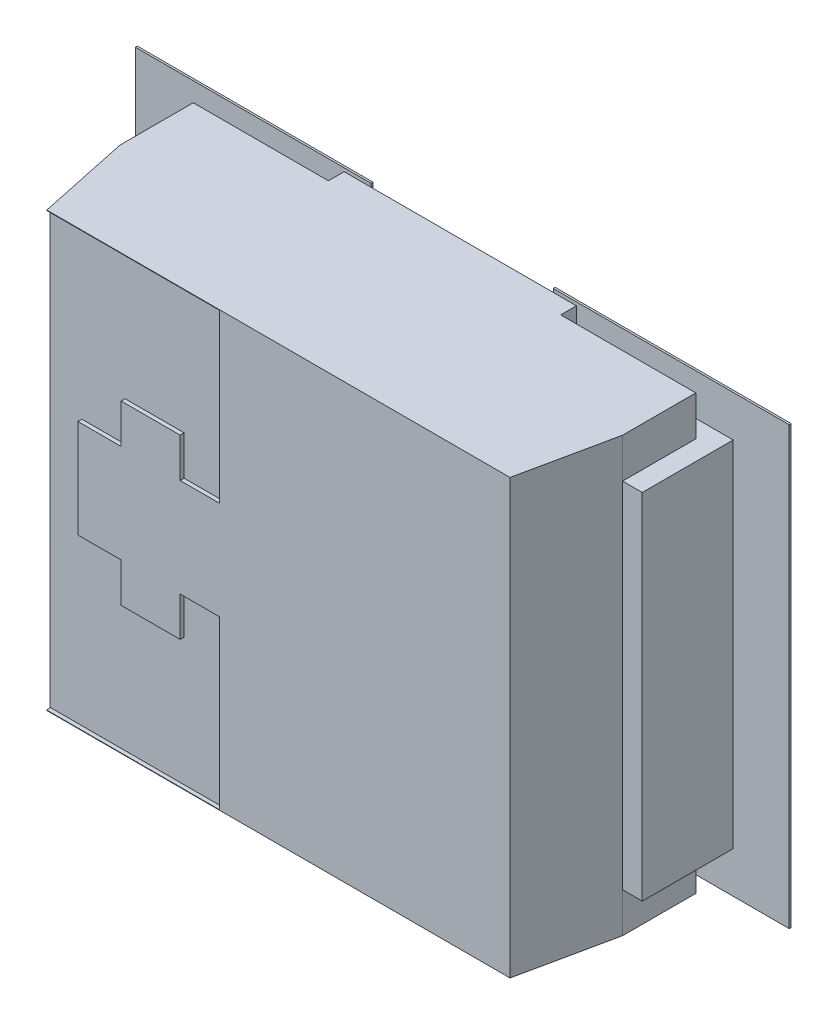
ISO-10303-21;
HEADER;
FILE_DESCRIPTION(('STEP AP214'),'2;1');
FILE_NAME('part.step','',(''),(''),'','','');
FILE_SCHEMA(('AUTOMOTIVE_DESIGN { 1 0 10303 214 1 1 1 1 }'));
ENDSEC;
DATA;
#1=APPLICATION_CONTEXT('core data for automotive mechanical design processes');
#2=APPLICATION_PROTOCOL_DEFINITION('international standard','automotive_design',2000,#1);
#3=PRODUCT_CONTEXT('',#1,'mechanical');
#4=PRODUCT('Part','Part','',(#3));
#5=PRODUCT_RELATED_PRODUCT_CATEGORY('part','',(#4));
#6=PRODUCT_DEFINITION_FORMATION('','',#4);
#7=PRODUCT_DEFINITION_CONTEXT('part definition',#1,'design');
#8=PRODUCT_DEFINITION('design','',#6,#7);
#9=PRODUCT_DEFINITION_SHAPE('','',#8);
#10=(LENGTH_UNIT() NAMED_UNIT(*) SI_UNIT(.MILLI.,.METRE.));
#11=(NAMED_UNIT(*) PLANE_ANGLE_UNIT() SI_UNIT($,.RADIAN.));
#12=(NAMED_UNIT(*) SI_UNIT($,.STERADIAN.) SOLID_ANGLE_UNIT());
#13=UNCERTAINTY_MEASURE_WITH_UNIT(LENGTH_MEASURE(1.E-05),#10,'distance_accuracy_value','');
#14=(GEOMETRIC_REPRESENTATION_CONTEXT(3) GLOBAL_UNCERTAINTY_ASSIGNED_CONTEXT((#13)) GLOBAL_UNIT_ASSIGNED_CONTEXT((#10,
#11,#12)) REPRESENTATION_CONTEXT('',''));
#15=CARTESIAN_POINT('',(0.,0.,0.));
#16=DIRECTION('',(0.,0.,1.));
#17=DIRECTION('',(1.,0.,0.));
#18=AXIS2_PLACEMENT_3D('',#15,#16,#17);
#19=CARTESIAN_POINT('',(0.,0.,1.250696));
#20=DIRECTION('',(0.,0.,1.));
#21=DIRECTION('',(1.,0.,0.));
#22=AXIS2_PLACEMENT_3D('',#19,#20,#21);
#23=PLANE('',#22);
#24=DIRECTION('',(0.,1.,0.));
#25=VECTOR('',#24,1.);
#26=CARTESIAN_POINT('',(-1.50137679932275,-1.39999999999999,1.25069600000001));
#27=LINE('',#26,#25);
#28=CARTESIAN_POINT('',(-1.50137679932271,1.397,1.250696));
#29=VERTEX_POINT('',#28);
#30=CARTESIAN_POINT('',(-1.50137679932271,-1.397,1.250696));
#31=VERTEX_POINT('',#30);
#32=EDGE_CURVE('E325',#29,#31,#27,.F.);
#33=ORIENTED_EDGE('',*,*,#32,.T.);
#34=DIRECTION('',(1.,0.,0.));
#35=VECTOR('',#34,1.);
#36=CARTESIAN_POINT('',(0.,-1.397,1.250696));
#37=LINE('',#36,#35);
#38=CARTESIAN_POINT('',(-0.381,-1.397,1.250696));
#39=VERTEX_POINT('',#38);
#40=EDGE_CURVE('E323',#31,#39,#37,.T.);
#41=ORIENTED_EDGE('',*,*,#40,.T.);
#42=DIRECTION('',(0.,1.,0.));
#43=VECTOR('',#42,1.);
#44=CARTESIAN_POINT('',(-0.381,0.,1.250696));
#45=LINE('',#44,#43);
#46=CARTESIAN_POINT('',(-0.381,-0.3175,1.250696));
#47=VERTEX_POINT('',#46);
#48=EDGE_CURVE('E19',#39,#47,#45,.T.);
#49=ORIENTED_EDGE('',*,*,#48,.T.);
#50=DIRECTION('',(1.,0.,0.));
#51=VECTOR('',#50,1.);
#52=CARTESIAN_POINT('',(0.,-0.3175,1.250696));
#53=LINE('',#52,#51);
#54=CARTESIAN_POINT('',(-0.635,-0.3175,1.250696));
#55=VERTEX_POINT('',#54);
#56=EDGE_CURVE('E310',#47,#55,#53,.F.);
#57=ORIENTED_EDGE('',*,*,#56,.T.);
#58=DIRECTION('',(0.,1.,0.));
#59=VECTOR('',#58,1.);
#60=CARTESIAN_POINT('',(-0.635,0.,1.250696));
#61=LINE('',#60,#59);
#62=CARTESIAN_POINT('',(-0.635,-0.5715,1.250696));
#63=VERTEX_POINT('',#62);
#64=EDGE_CURVE('E315',#55,#63,#61,.F.);
#65=ORIENTED_EDGE('',*,*,#64,.T.);
#66=DIRECTION('',(1.,0.,0.));
#67=VECTOR('',#66,1.);
#68=CARTESIAN_POINT('',(0.,-0.5715,1.250696));
#69=LINE('',#68,#67);
#70=CARTESIAN_POINT('',(-1.016,-0.5715,1.250696));
#71=VERTEX_POINT('',#70);
#72=EDGE_CURVE('E362',#63,#71,#69,.F.);
#73=ORIENTED_EDGE('',*,*,#72,.T.);
#74=DIRECTION('',(0.,1.,0.));
#75=VECTOR('',#74,1.);
#76=CARTESIAN_POINT('',(-1.016,0.,1.250696));
#77=LINE('',#76,#75);
#78=CARTESIAN_POINT('',(-1.016,-0.3175,1.250696));
#79=VERTEX_POINT('',#78);
#80=EDGE_CURVE('E359',#71,#79,#77,.T.);
#81=ORIENTED_EDGE('',*,*,#80,.T.);
#82=DIRECTION('',(1.,0.,0.));
#83=VECTOR('',#82,1.);
#84=CARTESIAN_POINT('',(0.,-0.3175,1.250696));
#85=LINE('',#84,#83);
#86=CARTESIAN_POINT('',(-1.2954,-0.3175,1.250696));
#87=VERTEX_POINT('',#86);
#88=EDGE_CURVE('E356',#79,#87,#85,.F.);
#89=ORIENTED_EDGE('',*,*,#88,.T.);
#90=DIRECTION('',(0.,1.,0.));
#91=VECTOR('',#90,1.);
#92=CARTESIAN_POINT('',(-1.2954,0.,1.250696));
#93=LINE('',#92,#91);
#94=CARTESIAN_POINT('',(-1.2954,0.3175,1.250696));
#95=VERTEX_POINT('',#94);
#96=EDGE_CURVE('E353',#87,#95,#93,.T.);
#97=ORIENTED_EDGE('',*,*,#96,.T.);
#98=DIRECTION('',(1.,0.,0.));
#99=VECTOR('',#98,1.);
#100=CARTESIAN_POINT('',(0.,0.3175,1.250696));
#101=LINE('',#100,#99);
#102=CARTESIAN_POINT('',(-1.016,0.3175,1.250696));
#103=VERTEX_POINT('',#102);
#104=EDGE_CURVE('E350',#95,#103,#101,.T.);
#105=ORIENTED_EDGE('',*,*,#104,.T.);
#106=DIRECTION('',(0.,1.,0.));
#107=VECTOR('',#106,1.);
#108=CARTESIAN_POINT('',(-1.016,0.,1.250696));
#109=LINE('',#108,#107);
#110=CARTESIAN_POINT('',(-1.016,0.5715,1.250696));
#111=VERTEX_POINT('',#110);
#112=EDGE_CURVE('E347',#103,#111,#109,.T.);
#113=ORIENTED_EDGE('',*,*,#112,.T.);
#114=DIRECTION('',(1.,0.,0.));
#115=VECTOR('',#114,1.);
#116=CARTESIAN_POINT('',(0.,0.5715,1.250696));
#117=LINE('',#116,#115);
#118=CARTESIAN_POINT('',(-0.635,0.5715,1.250696));
#119=VERTEX_POINT('',#118);
#120=EDGE_CURVE('E344',#111,#119,#117,.T.);
#121=ORIENTED_EDGE('',*,*,#120,.T.);
#122=DIRECTION('',(0.,1.,0.));
#123=VECTOR('',#122,1.);
#124=CARTESIAN_POINT('',(-0.635,0.,1.250696));
#125=LINE('',#124,#123);
#126=CARTESIAN_POINT('',(-0.635,0.3175,1.250696));
#127=VERTEX_POINT('',#126);
#128=EDGE_CURVE('E341',#119,#127,#125,.F.);
#129=ORIENTED_EDGE('',*,*,#128,.T.);
#130=DIRECTION('',(1.,0.,0.));
#131=VECTOR('',#130,1.);
#132=CARTESIAN_POINT('',(0.,0.3175,1.250696));
#133=LINE('',#132,#131);
#134=CARTESIAN_POINT('',(-0.381,0.3175,1.250696));
#135=VERTEX_POINT('',#134);
#136=EDGE_CURVE('E338',#127,#135,#133,.T.);
#137=ORIENTED_EDGE('',*,*,#136,.T.);
#138=DIRECTION('',(0.,1.,0.));
#139=VECTOR('',#138,1.);
#140=CARTESIAN_POINT('',(-0.381,0.,1.250696));
#141=LINE('',#140,#139);
#142=CARTESIAN_POINT('',(-0.381,1.397,1.250696));
#143=VERTEX_POINT('',#142);
#144=EDGE_CURVE('E332',#135,#143,#141,.T.);
#145=ORIENTED_EDGE('',*,*,#144,.T.);
#146=DIRECTION('',(1.,0.,0.));
#147=VECTOR('',#146,1.);
#148=CARTESIAN_POINT('',(0.,1.397,1.250696));
#149=LINE('',#148,#147);
#150=EDGE_CURVE('E328',#143,#29,#149,.F.);
#151=ORIENTED_EDGE('',*,*,#150,.T.);
#152=EDGE_LOOP('',(#33,#41,#49,#57,#65,#73,#81,#89,#97,#105,#113,#121,#129,#137,#145,#151));
#153=FACE_BOUND('',#152,.T.);
#154=ADVANCED_FACE('F16',(#153),#23,.T.);
#155=CARTESIAN_POINT('',(-1.62300000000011,-1.39999999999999,0.676148));
#156=DIRECTION('',(0.978320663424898,0.,-0.2070958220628));
#157=DIRECTION('',(-0.2070958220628,0.,-0.978320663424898));
#158=AXIS2_PLACEMENT_3D('',#155,#156,#157);
#159=PLANE('',#158);
#160=DIRECTION('',(0.,1.,0.));
#161=VECTOR('',#160,1.);
#162=CARTESIAN_POINT('',(-1.49600000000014,-1.39999999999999,1.27609600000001));
#163=LINE('',#162,#161);
#164=CARTESIAN_POINT('',(-1.49600000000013,1.39999999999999,1.276096));
#165=VERTEX_POINT('',#164);
#166=CARTESIAN_POINT('',(-1.49600000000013,1.397,1.276096));
#167=VERTEX_POINT('',#166);
#168=EDGE_CURVE('E623',#165,#167,#163,.F.);
#169=ORIENTED_EDGE('',*,*,#168,.F.);
#170=DIRECTION('',(-0.2070958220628,0.,-0.978320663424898));
#171=VECTOR('',#170,1.);
#172=CARTESIAN_POINT('',(-1.62300000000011,1.39999999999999,0.676148));
#173=LINE('',#172,#171);
#174=CARTESIAN_POINT('',(-1.62300000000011,1.39999999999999,0.676148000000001));
#175=VERTEX_POINT('',#174);
#176=EDGE_CURVE('E625',#175,#165,#173,.F.);
#177=ORIENTED_EDGE('',*,*,#176,.F.);
#178=DIRECTION('',(0.,1.,0.));
#179=VECTOR('',#178,1.);
#180=CARTESIAN_POINT('',(-1.62300000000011,-1.39999999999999,0.676148));
#181=LINE('',#180,#179);
#182=CARTESIAN_POINT('',(-1.62300000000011,1.143,0.676148));
#183=VERTEX_POINT('',#182);
#184=EDGE_CURVE('E627',#183,#175,#181,.T.);
#185=ORIENTED_EDGE('',*,*,#184,.F.);
#186=DIRECTION('',(0.,1.,0.));
#187=VECTOR('',#186,1.);
#188=CARTESIAN_POINT('',(-1.62300000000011,-1.143,0.676148));
#189=LINE('',#188,#187);
#190=CARTESIAN_POINT('',(-1.62300000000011,-1.143,0.676148));
#191=VERTEX_POINT('',#190);
#192=EDGE_CURVE('E612',#191,#183,#189,.T.);
#193=ORIENTED_EDGE('',*,*,#192,.F.);
#194=DIRECTION('',(0.,1.,0.));
#195=VECTOR('',#194,1.);
#196=CARTESIAN_POINT('',(-1.62300000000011,-1.39999999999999,0.676148));
#197=LINE('',#196,#195);
#198=CARTESIAN_POINT('',(-1.62300000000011,-1.39999999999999,0.676148));
#199=VERTEX_POINT('',#198);
#200=EDGE_CURVE('E629',#199,#191,#197,.T.);
#201=ORIENTED_EDGE('',*,*,#200,.F.);
#202=DIRECTION('',(-0.2070958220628,0.,-0.978320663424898));
#203=VECTOR('',#202,1.);
#204=CARTESIAN_POINT('',(-1.62300000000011,-1.39999999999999,0.676148));
#205=LINE('',#204,#203);
#206=CARTESIAN_POINT('',(-1.49600000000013,-1.39999999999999,1.276096));
#207=VERTEX_POINT('',#206);
#208=EDGE_CURVE('E631',#207,#199,#205,.T.);
#209=ORIENTED_EDGE('',*,*,#208,.F.);
#210=DIRECTION('',(0.,1.,0.));
#211=VECTOR('',#210,1.);
#212=CARTESIAN_POINT('',(-1.49600000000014,-1.39999999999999,1.27609600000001));
#213=LINE('',#212,#211);
#214=CARTESIAN_POINT('',(-1.49600000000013,-1.397,1.276096));
#215=VERTEX_POINT('',#214);
#216=EDGE_CURVE('E633',#215,#207,#213,.F.);
#217=ORIENTED_EDGE('',*,*,#216,.F.);
#218=DIRECTION('',(-0.2070958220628,0.,-0.978320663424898));
#219=VECTOR('',#218,1.);
#220=CARTESIAN_POINT('',(-1.62300000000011,-1.397,0.676148));
#221=LINE('',#220,#219);
#222=EDGE_CURVE('E330',#31,#215,#221,.F.);
#223=ORIENTED_EDGE('',*,*,#222,.F.);
#224=ORIENTED_EDGE('',*,*,#32,.F.);
#225=DIRECTION('',(-0.2070958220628,0.,-0.978320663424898));
#226=VECTOR('',#225,1.);
#227=CARTESIAN_POINT('',(-1.62300000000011,1.397,0.676148));
#228=LINE('',#227,#226);
#229=EDGE_CURVE('E620',#167,#29,#228,.T.);
#230=ORIENTED_EDGE('',*,*,#229,.F.);
#231=EDGE_LOOP('',(#169,#177,#185,#193,#201,#209,#217,#223,#224,#230));
#232=FACE_BOUND('',#231,.T.);
#233=ADVANCED_FACE('F646',(#232),#159,.F.);
#234=CARTESIAN_POINT('',(-0.95000000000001,-1.143,0.0762));
#235=DIRECTION('',(0.,0.,-1.));
#236=DIRECTION('',(-1.,0.,0.));
#237=AXIS2_PLACEMENT_3D('',#234,#235,#236);
#238=PLANE('',#237);
#239=DIRECTION('',(1.,0.,0.));
#240=VECTOR('',#239,1.);
#241=CARTESIAN_POINT('',(-2.11201,-1.4094968,0.0762));
#242=LINE('',#241,#240);
#243=CARTESIAN_POINT('',(-2.11201,-1.4094968,0.0762));
#244=VERTEX_POINT('',#243);
#245=CARTESIAN_POINT('',(-0.58801,-1.4094968,0.0762));
#246=VERTEX_POINT('',#245);
#247=EDGE_CURVE('E610',#244,#246,#242,.T.);
#248=ORIENTED_EDGE('',*,*,#247,.F.);
#249=DIRECTION('',(0.,1.,0.));
#250=VECTOR('',#249,1.);
#251=CARTESIAN_POINT('',(-2.11201,1.4094968,0.0762));
#252=LINE('',#251,#250);
#253=CARTESIAN_POINT('',(-2.11201,1.4094968,0.0762));
#254=VERTEX_POINT('',#253);
#255=EDGE_CURVE('E591',#254,#244,#252,.F.);
#256=ORIENTED_EDGE('',*,*,#255,.F.);
#257=DIRECTION('',(1.,0.,0.));
#258=VECTOR('',#257,1.);
#259=CARTESIAN_POINT('',(-0.58801,1.4094968,0.0762));
#260=LINE('',#259,#258);
#261=CARTESIAN_POINT('',(-0.58801,1.4094968,0.0762));
#262=VERTEX_POINT('',#261);
#263=EDGE_CURVE('E600',#262,#254,#260,.F.);
#264=ORIENTED_EDGE('',*,*,#263,.F.);
#265=DIRECTION('',(0.,1.,0.));
#266=VECTOR('',#265,1.);
#267=CARTESIAN_POINT('',(-0.58801,-1.4094968,0.0762));
#268=LINE('',#267,#266);
#269=EDGE_CURVE('E605',#246,#262,#268,.T.);
#270=ORIENTED_EDGE('',*,*,#269,.F.);
#271=EDGE_LOOP('',(#248,#256,#264,#270));
#272=FACE_BOUND('',#271,.T.);
#273=ADVANCED_FACE('F1122',(#272),#238,.T.);
#274=CARTESIAN_POINT('',(-1.75000000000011,-1.143,0.676148));
#275=DIRECTION('',(0.,0.,1.));
#276=DIRECTION('',(1.,0.,0.));
#277=AXIS2_PLACEMENT_3D('',#274,#275,#276);
#278=PLANE('',#277);
#279=DIRECTION('',(1.,0.,0.));
#280=VECTOR('',#279,1.);
#281=CARTESIAN_POINT('',(-1.75000000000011,-1.143,0.676148));
#282=LINE('',#281,#280);
#283=CARTESIAN_POINT('',(-1.75000000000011,-1.143,0.676148));
#284=VERTEX_POINT('',#283);
#285=EDGE_CURVE('E615',#284,#191,#282,.T.);
#286=ORIENTED_EDGE('',*,*,#285,.T.);
#287=ORIENTED_EDGE('',*,*,#192,.T.);
#288=DIRECTION('',(1.,0.,0.));
#289=VECTOR('',#288,1.);
#290=CARTESIAN_POINT('',(-1.75000000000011,1.143,0.676148));
#291=LINE('',#290,#289);
#292=CARTESIAN_POINT('',(-1.75000000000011,1.143,0.676148));
#293=VERTEX_POINT('',#292);
#294=EDGE_CURVE('E618',#183,#293,#291,.F.);
#295=ORIENTED_EDGE('',*,*,#294,.T.);
#296=DIRECTION('',(0.,1.,0.));
#297=VECTOR('',#296,1.);
#298=CARTESIAN_POINT('',(-1.75000000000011,-1.143,0.676148));
#299=LINE('',#298,#297);
#300=EDGE_CURVE('E585',#284,#293,#299,.T.);
#301=ORIENTED_EDGE('',*,*,#300,.F.);
#302=EDGE_LOOP('',(#286,#287,#295,#301));
#303=FACE_BOUND('',#302,.T.);
#304=ADVANCED_FACE('F806',(#303),#278,.T.);
#305=CARTESIAN_POINT('',(-2.11201,-1.4094968,0.0762));
#306=DIRECTION('',(0.,-1.,0.));
#307=DIRECTION('',(0.,0.,-1.));
#308=AXIS2_PLACEMENT_3D('',#305,#306,#307);
#309=PLANE('',#308);
#310=DIRECTION('',(0.,0.,1.));
#311=VECTOR('',#310,1.);
#312=CARTESIAN_POINT('',(-2.11201,-1.4094968,0.0762));
#313=LINE('',#312,#311);
#314=CARTESIAN_POINT('',(-2.11201,-1.4094968,0.0889));
#315=VERTEX_POINT('',#314);
#316=EDGE_CURVE('E597',#244,#315,#313,.T.);
#317=ORIENTED_EDGE('',*,*,#316,.F.);
#318=ORIENTED_EDGE('',*,*,#247,.T.);
#319=DIRECTION('',(0.,0.,-1.));
#320=VECTOR('',#319,1.);
#321=CARTESIAN_POINT('',(-0.58801,-1.4094968,0.0762));
#322=LINE('',#321,#320);
#323=CARTESIAN_POINT('',(-0.58801,-1.4094968,0.0889));
#324=VERTEX_POINT('',#323);
#325=EDGE_CURVE('E607',#324,#246,#322,.T.);
#326=ORIENTED_EDGE('',*,*,#325,.F.);
#327=DIRECTION('',(1.,0.,0.));
#328=VECTOR('',#327,1.);
#329=CARTESIAN_POINT('',(0.,-1.4094968,0.0889));
#330=LINE('',#329,#328);
#331=EDGE_CURVE('E580',#315,#324,#330,.T.);
#332=ORIENTED_EDGE('',*,*,#331,.F.);
#333=EDGE_LOOP('',(#317,#318,#326,#332));
#334=FACE_BOUND('',#333,.T.);
#335=ADVANCED_FACE('F1121',(#334),#309,.T.);
#336=CARTESIAN_POINT('',(-0.58801,-1.4094968,0.0762));
#337=DIRECTION('',(1.,0.,0.));
#338=DIRECTION('',(0.,0.,-1.));
#339=AXIS2_PLACEMENT_3D('',#336,#337,#338);
#340=PLANE('',#339);
#341=ORIENTED_EDGE('',*,*,#325,.T.);
#342=ORIENTED_EDGE('',*,*,#269,.T.);
#343=DIRECTION('',(0.,0.,1.));
#344=VECTOR('',#343,1.);
#345=CARTESIAN_POINT('',(-0.58801,1.4094968,0.0762));
#346=LINE('',#345,#344);
#347=CARTESIAN_POINT('',(-0.58801,1.4094968,0.0889));
#348=VERTEX_POINT('',#347);
#349=EDGE_CURVE('E602',#348,#262,#346,.F.);
#350=ORIENTED_EDGE('',*,*,#349,.F.);
#351=DIRECTION('',(0.,1.,0.));
#352=VECTOR('',#351,1.);
#353=CARTESIAN_POINT('',(-0.58801,0.,0.0889));
#354=LINE('',#353,#352);
#355=EDGE_CURVE('E577',#324,#348,#354,.T.);
#356=ORIENTED_EDGE('',*,*,#355,.F.);
#357=EDGE_LOOP('',(#341,#342,#350,#356));
#358=FACE_BOUND('',#357,.T.);
#359=ADVANCED_FACE('F1184',(#358),#340,.T.);
#360=CARTESIAN_POINT('',(-0.58801,1.4094968,0.0762));
#361=DIRECTION('',(0.,1.,0.));
#362=DIRECTION('',(0.,0.,1.));
#363=AXIS2_PLACEMENT_3D('',#360,#361,#362);
#364=PLANE('',#363);
#365=ORIENTED_EDGE('',*,*,#349,.T.);
#366=ORIENTED_EDGE('',*,*,#263,.T.);
#367=DIRECTION('',(0.,0.,1.));
#368=VECTOR('',#367,1.);
#369=CARTESIAN_POINT('',(-2.11201,1.4094968,0.0762));
#370=LINE('',#369,#368);
#371=CARTESIAN_POINT('',(-2.11201,1.4094968,0.0889));
#372=VERTEX_POINT('',#371);
#373=EDGE_CURVE('E594',#372,#254,#370,.F.);
#374=ORIENTED_EDGE('',*,*,#373,.F.);
#375=DIRECTION('',(1.,0.,0.));
#376=VECTOR('',#375,1.);
#377=CARTESIAN_POINT('',(0.,1.4094968,0.0889));
#378=LINE('',#377,#376);
#379=EDGE_CURVE('E574',#348,#372,#378,.F.);
#380=ORIENTED_EDGE('',*,*,#379,.F.);
#381=EDGE_LOOP('',(#365,#366,#374,#380));
#382=FACE_BOUND('',#381,.T.);
#383=ADVANCED_FACE('F1191',(#382),#364,.T.);
#384=CARTESIAN_POINT('',(-2.11201,1.4094968,0.0762));
#385=DIRECTION('',(-1.,0.,0.));
#386=DIRECTION('',(0.,0.,1.));
#387=AXIS2_PLACEMENT_3D('',#384,#385,#386);
#388=PLANE('',#387);
#389=ORIENTED_EDGE('',*,*,#373,.T.);
#390=ORIENTED_EDGE('',*,*,#255,.T.);
#391=ORIENTED_EDGE('',*,*,#316,.T.);
#392=DIRECTION('',(0.,1.,0.));
#393=VECTOR('',#392,1.);
#394=CARTESIAN_POINT('',(-2.11201,0.,0.0889));
#395=LINE('',#394,#393);
#396=EDGE_CURVE('E571',#372,#315,#395,.F.);
#397=ORIENTED_EDGE('',*,*,#396,.F.);
#398=EDGE_LOOP('',(#389,#390,#391,#397));
#399=FACE_BOUND('',#398,.T.);
#400=ADVANCED_FACE('F1109',(#399),#388,.T.);
#401=CARTESIAN_POINT('',(-1.75000000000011,-1.143,0.0762));
#402=DIRECTION('',(-1.,0.,0.));
#403=DIRECTION('',(0.,0.,1.));
#404=AXIS2_PLACEMENT_3D('',#401,#402,#403);
#405=PLANE('',#404);
#406=DIRECTION('',(0.,0.,1.));
#407=VECTOR('',#406,1.);
#408=CARTESIAN_POINT('',(-1.75000000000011,1.143,0.0762));
#409=LINE('',#408,#407);
#410=CARTESIAN_POINT('',(-1.75000000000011,1.143,0.0889));
#411=VERTEX_POINT('',#410);
#412=EDGE_CURVE('E583',#293,#411,#409,.F.);
#413=ORIENTED_EDGE('',*,*,#412,.T.);
#414=DIRECTION('',(0.,1.,0.));
#415=VECTOR('',#414,1.);
#416=CARTESIAN_POINT('',(-1.75000000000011,0.,0.0889));
#417=LINE('',#416,#415);
#418=CARTESIAN_POINT('',(-1.75000000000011,-1.143,0.0889));
#419=VERTEX_POINT('',#418);
#420=EDGE_CURVE('E568',#419,#411,#417,.T.);
#421=ORIENTED_EDGE('',*,*,#420,.F.);
#422=DIRECTION('',(0.,0.,1.));
#423=VECTOR('',#422,1.);
#424=CARTESIAN_POINT('',(-1.75000000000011,-1.143,0.0762));
#425=LINE('',#424,#423);
#426=EDGE_CURVE('E588',#419,#284,#425,.T.);
#427=ORIENTED_EDGE('',*,*,#426,.T.);
#428=ORIENTED_EDGE('',*,*,#300,.T.);
#429=EDGE_LOOP('',(#413,#421,#427,#428));
#430=FACE_BOUND('',#429,.T.);
#431=ADVANCED_FACE('F804',(#430),#405,.T.);
#432=CARTESIAN_POINT('',(0.,0.,0.0889));
#433=DIRECTION('',(0.,0.,1.));
#434=DIRECTION('',(1.,0.,0.));
#435=AXIS2_PLACEMENT_3D('',#432,#433,#434);
#436=PLANE('',#435);
#437=DIRECTION('',(0.,1.,0.));
#438=VECTOR('',#437,1.);
#439=CARTESIAN_POINT('',(-0.95000000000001,-1.143,0.0889));
#440=LINE('',#439,#438);
#441=CARTESIAN_POINT('',(-0.95000000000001,-1.143,0.0889));
#442=VERTEX_POINT('',#441);
#443=CARTESIAN_POINT('',(-0.95000000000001,1.143,0.0889));
#444=VERTEX_POINT('',#443);
#445=EDGE_CURVE('E553',#442,#444,#440,.T.);
#446=ORIENTED_EDGE('',*,*,#445,.F.);
#447=DIRECTION('',(1.,0.,0.));
#448=VECTOR('',#447,1.);
#449=CARTESIAN_POINT('',(0.,-1.143,0.0889));
#450=LINE('',#449,#448);
#451=EDGE_CURVE('E562',#442,#419,#450,.F.);
#452=ORIENTED_EDGE('',*,*,#451,.T.);
#453=ORIENTED_EDGE('',*,*,#420,.T.);
#454=DIRECTION('',(1.,0.,0.));
#455=VECTOR('',#454,1.);
#456=CARTESIAN_POINT('',(0.,1.143,0.0889));
#457=LINE('',#456,#455);
#458=EDGE_CURVE('E565',#411,#444,#457,.T.);
#459=ORIENTED_EDGE('',*,*,#458,.T.);
#460=EDGE_LOOP('',(#446,#452,#453,#459));
#461=FACE_BOUND('',#460,.T.);
#462=ORIENTED_EDGE('',*,*,#379,.T.);
#463=ORIENTED_EDGE('',*,*,#396,.T.);
#464=ORIENTED_EDGE('',*,*,#331,.T.);
#465=ORIENTED_EDGE('',*,*,#355,.T.);
#466=EDGE_LOOP('',(#462,#463,#464,#465));
#467=FACE_BOUND('',#466,.T.);
#468=ADVANCED_FACE('F798',(#461,#467),#436,.T.);
#469=CARTESIAN_POINT('',(-0.95000000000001,-1.143,0.2032));
#470=DIRECTION('',(1.,0.,0.));
#471=DIRECTION('',(0.,0.,-1.));
#472=AXIS2_PLACEMENT_3D('',#469,#470,#471);
#473=PLANE('',#472);
#474=DIRECTION('',(0.,0.,-1.));
#475=VECTOR('',#474,1.);
#476=CARTESIAN_POINT('',(-0.95000000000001,-1.143,0.2032));
#477=LINE('',#476,#475);
#478=CARTESIAN_POINT('',(-0.95000000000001,-1.143,0.2032));
#479=VERTEX_POINT('',#478);
#480=EDGE_CURVE('E556',#479,#442,#477,.T.);
#481=ORIENTED_EDGE('',*,*,#480,.T.);
#482=ORIENTED_EDGE('',*,*,#445,.T.);
#483=DIRECTION('',(0.,0.,-1.));
#484=VECTOR('',#483,1.);
#485=CARTESIAN_POINT('',(-0.95000000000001,1.143,0.2032));
#486=LINE('',#485,#484);
#487=CARTESIAN_POINT('',(-0.95000000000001,1.143,0.2032));
#488=VERTEX_POINT('',#487);
#489=EDGE_CURVE('E559',#444,#488,#486,.F.);
#490=ORIENTED_EDGE('',*,*,#489,.T.);
#491=DIRECTION('',(0.,1.,0.));
#492=VECTOR('',#491,1.);
#493=CARTESIAN_POINT('',(-0.95000000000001,-1.39999999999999,0.2032));
#494=LINE('',#493,#492);
#495=EDGE_CURVE('E538',#488,#479,#494,.F.);
#496=ORIENTED_EDGE('',*,*,#495,.T.);
#497=EDGE_LOOP('',(#481,#482,#490,#496));
#498=FACE_BOUND('',#497,.T.);
#499=ADVANCED_FACE('F795',(#498),#473,.T.);
#500=CARTESIAN_POINT('',(-0.750000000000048,-1.39999999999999,0.2032));
#501=DIRECTION('',(0.,0.,1.));
#502=DIRECTION('',(1.,0.,0.));
#503=AXIS2_PLACEMENT_3D('',#500,#501,#502);
#504=PLANE('',#503);
#505=DIRECTION('',(1.,0.,0.));
#506=VECTOR('',#505,1.);
#507=CARTESIAN_POINT('',(-0.750000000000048,1.143,0.2032));
#508=LINE('',#507,#506);
#509=CARTESIAN_POINT('',(-1.62300000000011,1.143,0.2032));
#510=VERTEX_POINT('',#509);
#511=EDGE_CURVE('E541',#510,#488,#508,.T.);
#512=ORIENTED_EDGE('',*,*,#511,.F.);
#513=DIRECTION('',(0.,1.,0.));
#514=VECTOR('',#513,1.);
#515=CARTESIAN_POINT('',(-1.62300000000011,-1.39999999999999,0.2032));
#516=LINE('',#515,#514);
#517=CARTESIAN_POINT('',(-1.62300000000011,1.39999999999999,0.2032));
#518=VERTEX_POINT('',#517);
#519=EDGE_CURVE('E543',#518,#510,#516,.F.);
#520=ORIENTED_EDGE('',*,*,#519,.F.);
#521=DIRECTION('',(1.,0.,0.));
#522=VECTOR('',#521,1.);
#523=CARTESIAN_POINT('',(-0.750000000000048,1.39999999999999,0.2032));
#524=LINE('',#523,#522);
#525=CARTESIAN_POINT('',(-0.750000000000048,1.39999999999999,0.2032));
#526=VERTEX_POINT('',#525);
#527=EDGE_CURVE('E545',#526,#518,#524,.F.);
#528=ORIENTED_EDGE('',*,*,#527,.F.);
#529=DIRECTION('',(0.,1.,0.));
#530=VECTOR('',#529,1.);
#531=CARTESIAN_POINT('',(-0.750000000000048,-1.39999999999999,0.2032));
#532=LINE('',#531,#530);
#533=CARTESIAN_POINT('',(-0.750000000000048,-1.39999999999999,0.2032));
#534=VERTEX_POINT('',#533);
#535=EDGE_CURVE('E531',#526,#534,#532,.F.);
#536=ORIENTED_EDGE('',*,*,#535,.T.);
#537=DIRECTION('',(1.,0.,0.));
#538=VECTOR('',#537,1.);
#539=CARTESIAN_POINT('',(-0.750000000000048,-1.39999999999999,0.2032));
#540=LINE('',#539,#538);
#541=CARTESIAN_POINT('',(-1.62300000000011,-1.39999999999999,0.2032));
#542=VERTEX_POINT('',#541);
#543=EDGE_CURVE('E547',#542,#534,#540,.T.);
#544=ORIENTED_EDGE('',*,*,#543,.F.);
#545=DIRECTION('',(0.,1.,0.));
#546=VECTOR('',#545,1.);
#547=CARTESIAN_POINT('',(-1.62300000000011,-1.39999999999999,0.2032));
#548=LINE('',#547,#546);
#549=CARTESIAN_POINT('',(-1.62300000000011,-1.143,0.2032));
#550=VERTEX_POINT('',#549);
#551=EDGE_CURVE('E549',#550,#542,#548,.F.);
#552=ORIENTED_EDGE('',*,*,#551,.F.);
#553=DIRECTION('',(1.,0.,0.));
#554=VECTOR('',#553,1.);
#555=CARTESIAN_POINT('',(-0.750000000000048,-1.143,0.2032));
#556=LINE('',#555,#554);
#557=EDGE_CURVE('E551',#479,#550,#556,.F.);
#558=ORIENTED_EDGE('',*,*,#557,.F.);
#559=ORIENTED_EDGE('',*,*,#495,.F.);
#560=EDGE_LOOP('',(#512,#520,#528,#536,#544,#552,#558,#559));
#561=FACE_BOUND('',#560,.T.);
#562=ADVANCED_FACE('F660',(#561),#504,.F.);
#563=CARTESIAN_POINT('',(-0.750000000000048,-1.39999999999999,0.1016));
#564=DIRECTION('',(1.,0.,0.));
#565=DIRECTION('',(0.,0.,-1.));
#566=AXIS2_PLACEMENT_3D('',#563,#564,#565);
#567=PLANE('',#566);
#568=DIRECTION('',(0.,0.,-1.));
#569=VECTOR('',#568,1.);
#570=CARTESIAN_POINT('',(-0.750000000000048,1.39999999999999,0.1016));
#571=LINE('',#570,#569);
#572=CARTESIAN_POINT('',(-0.750000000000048,1.39999999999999,0.1016));
#573=VERTEX_POINT('',#572);
#574=EDGE_CURVE('E534',#573,#526,#571,.F.);
#575=ORIENTED_EDGE('',*,*,#574,.F.);
#576=DIRECTION('',(0.,1.,0.));
#577=VECTOR('',#576,1.);
#578=CARTESIAN_POINT('',(-0.750000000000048,-1.39999999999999,0.1016));
#579=LINE('',#578,#577);
#580=CARTESIAN_POINT('',(-0.750000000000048,-1.39999999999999,0.1016));
#581=VERTEX_POINT('',#580);
#582=EDGE_CURVE('E524',#573,#581,#579,.F.);
#583=ORIENTED_EDGE('',*,*,#582,.T.);
#584=DIRECTION('',(0.,0.,-1.));
#585=VECTOR('',#584,1.);
#586=CARTESIAN_POINT('',(-0.750000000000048,-1.39999999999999,0.1016));
#587=LINE('',#586,#585);
#588=EDGE_CURVE('E536',#534,#581,#587,.T.);
#589=ORIENTED_EDGE('',*,*,#588,.F.);
#590=ORIENTED_EDGE('',*,*,#535,.F.);
#591=EDGE_LOOP('',(#575,#583,#589,#590));
#592=FACE_BOUND('',#591,.T.);
#593=ADVANCED_FACE('F669',(#592),#567,.F.);
#594=CARTESIAN_POINT('',(0.750000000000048,-1.39999999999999,0.1016));
#595=DIRECTION('',(0.,0.,1.));
#596=DIRECTION('',(1.,0.,0.));
#597=AXIS2_PLACEMENT_3D('',#594,#595,#596);
#598=PLANE('',#597);
#599=DIRECTION('',(1.,0.,0.));
#600=VECTOR('',#599,1.);
#601=CARTESIAN_POINT('',(0.750000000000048,1.39999999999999,0.1016));
#602=LINE('',#601,#600);
#603=CARTESIAN_POINT('',(0.750000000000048,1.39999999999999,0.1016));
#604=VERTEX_POINT('',#603);
#605=EDGE_CURVE('E527',#604,#573,#602,.F.);
#606=ORIENTED_EDGE('',*,*,#605,.F.);
#607=DIRECTION('',(0.,1.,0.));
#608=VECTOR('',#607,1.);
#609=CARTESIAN_POINT('',(0.750000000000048,-1.39999999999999,0.1016));
#610=LINE('',#609,#608);
#611=CARTESIAN_POINT('',(0.750000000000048,-1.39999999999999,0.1016));
#612=VERTEX_POINT('',#611);
#613=EDGE_CURVE('E517',#604,#612,#610,.F.);
#614=ORIENTED_EDGE('',*,*,#613,.T.);
#615=DIRECTION('',(1.,0.,0.));
#616=VECTOR('',#615,1.);
#617=CARTESIAN_POINT('',(0.750000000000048,-1.39999999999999,0.1016));
#618=LINE('',#617,#616);
#619=EDGE_CURVE('E529',#581,#612,#618,.T.);
#620=ORIENTED_EDGE('',*,*,#619,.F.);
#621=ORIENTED_EDGE('',*,*,#582,.F.);
#622=EDGE_LOOP('',(#606,#614,#620,#621));
#623=FACE_BOUND('',#622,.T.);
#624=ADVANCED_FACE('F672',(#623),#598,.F.);
#625=CARTESIAN_POINT('',(0.750000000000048,-1.39999999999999,0.2032));
#626=DIRECTION('',(-1.,0.,0.));
#627=DIRECTION('',(0.,0.,1.));
#628=AXIS2_PLACEMENT_3D('',#625,#626,#627);
#629=PLANE('',#628);
#630=DIRECTION('',(0.,0.,1.));
#631=VECTOR('',#630,1.);
#632=CARTESIAN_POINT('',(0.750000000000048,1.39999999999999,0.2032));
#633=LINE('',#632,#631);
#634=CARTESIAN_POINT('',(0.750000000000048,1.39999999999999,0.2032));
#635=VERTEX_POINT('',#634);
#636=EDGE_CURVE('E520',#635,#604,#633,.F.);
#637=ORIENTED_EDGE('',*,*,#636,.F.);
#638=DIRECTION('',(0.,1.,0.));
#639=VECTOR('',#638,1.);
#640=CARTESIAN_POINT('',(0.750000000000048,-1.39999999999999,0.2032));
#641=LINE('',#640,#639);
#642=CARTESIAN_POINT('',(0.750000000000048,-1.39999999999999,0.2032));
#643=VERTEX_POINT('',#642);
#644=EDGE_CURVE('E506',#635,#643,#641,.F.);
#645=ORIENTED_EDGE('',*,*,#644,.T.);
#646=DIRECTION('',(0.,0.,1.));
#647=VECTOR('',#646,1.);
#648=CARTESIAN_POINT('',(0.750000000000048,-1.39999999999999,0.2032));
#649=LINE('',#648,#647);
#650=EDGE_CURVE('E522',#612,#643,#649,.T.);
#651=ORIENTED_EDGE('',*,*,#650,.F.);
#652=ORIENTED_EDGE('',*,*,#613,.F.);
#653=EDGE_LOOP('',(#637,#645,#651,#652));
#654=FACE_BOUND('',#653,.T.);
#655=ADVANCED_FACE('F677',(#654),#629,.F.);
#656=CARTESIAN_POINT('',(-0.95000000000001,-1.143,0.0762));
#657=DIRECTION('',(0.,0.,-1.));
#658=DIRECTION('',(-1.,0.,0.));
#659=AXIS2_PLACEMENT_3D('',#656,#657,#658);
#660=PLANE('',#659);
#661=DIRECTION('',(1.,0.,0.));
#662=VECTOR('',#661,1.);
#663=CARTESIAN_POINT('',(2.11201,1.4094968,0.0762));
#664=LINE('',#663,#662);
#665=CARTESIAN_POINT('',(2.11201,1.4094968,0.0762));
#666=VERTEX_POINT('',#665);
#667=CARTESIAN_POINT('',(0.58801,1.4094968,0.0762));
#668=VERTEX_POINT('',#667);
#669=EDGE_CURVE('E500',#666,#668,#664,.F.);
#670=ORIENTED_EDGE('',*,*,#669,.F.);
#671=DIRECTION('',(0.,1.,0.));
#672=VECTOR('',#671,1.);
#673=CARTESIAN_POINT('',(2.11201,-1.4094968,0.0762));
#674=LINE('',#673,#672);
#675=CARTESIAN_POINT('',(2.11201,-1.4094968,0.0762));
#676=VERTEX_POINT('',#675);
#677=EDGE_CURVE('E481',#676,#666,#674,.T.);
#678=ORIENTED_EDGE('',*,*,#677,.F.);
#679=DIRECTION('',(1.,0.,0.));
#680=VECTOR('',#679,1.);
#681=CARTESIAN_POINT('',(0.58801,-1.4094968,0.0762));
#682=LINE('',#681,#680);
#683=CARTESIAN_POINT('',(0.58801,-1.4094968,0.0762));
#684=VERTEX_POINT('',#683);
#685=EDGE_CURVE('E490',#684,#676,#682,.T.);
#686=ORIENTED_EDGE('',*,*,#685,.F.);
#687=DIRECTION('',(0.,1.,0.));
#688=VECTOR('',#687,1.);
#689=CARTESIAN_POINT('',(0.58801,1.4094968,0.0762));
#690=LINE('',#689,#688);
#691=EDGE_CURVE('E495',#668,#684,#690,.F.);
#692=ORIENTED_EDGE('',*,*,#691,.F.);
#693=EDGE_LOOP('',(#670,#678,#686,#692));
#694=FACE_BOUND('',#693,.T.);
#695=ADVANCED_FACE('F1063',(#694),#660,.T.);
#696=CARTESIAN_POINT('',(1.75000000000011,-1.39999999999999,0.2032));
#697=DIRECTION('',(0.,0.,1.));
#698=DIRECTION('',(1.,0.,0.));
#699=AXIS2_PLACEMENT_3D('',#696,#697,#698);
#700=PLANE('',#699);
#701=DIRECTION('',(1.,0.,0.));
#702=VECTOR('',#701,1.);
#703=CARTESIAN_POINT('',(1.75000000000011,-1.39999999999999,0.2032));
#704=LINE('',#703,#702);
#705=CARTESIAN_POINT('',(1.62300000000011,-1.39999999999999,0.2032));
#706=VERTEX_POINT('',#705);
#707=EDGE_CURVE('E504',#643,#706,#704,.T.);
#708=ORIENTED_EDGE('',*,*,#707,.F.);
#709=ORIENTED_EDGE('',*,*,#644,.F.);
#710=DIRECTION('',(1.,0.,0.));
#711=VECTOR('',#710,1.);
#712=CARTESIAN_POINT('',(1.75000000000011,1.39999999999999,0.2032));
#713=LINE('',#712,#711);
#714=CARTESIAN_POINT('',(1.62300000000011,1.39999999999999,0.2032));
#715=VERTEX_POINT('',#714);
#716=EDGE_CURVE('E509',#715,#635,#713,.F.);
#717=ORIENTED_EDGE('',*,*,#716,.F.);
#718=DIRECTION('',(0.,1.,0.));
#719=VECTOR('',#718,1.);
#720=CARTESIAN_POINT('',(1.62300000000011,-1.39999999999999,0.2032));
#721=LINE('',#720,#719);
#722=CARTESIAN_POINT('',(1.62300000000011,1.143,0.2032));
#723=VERTEX_POINT('',#722);
#724=EDGE_CURVE('E511',#723,#715,#721,.T.);
#725=ORIENTED_EDGE('',*,*,#724,.F.);
#726=DIRECTION('',(1.,0.,0.));
#727=VECTOR('',#726,1.);
#728=CARTESIAN_POINT('',(1.75000000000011,1.143,0.2032));
#729=LINE('',#728,#727);
#730=CARTESIAN_POINT('',(0.95000000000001,1.143,0.2032));
#731=VERTEX_POINT('',#730);
#732=EDGE_CURVE('E513',#731,#723,#729,.T.);
#733=ORIENTED_EDGE('',*,*,#732,.F.);
#734=DIRECTION('',(0.,1.,0.));
#735=VECTOR('',#734,1.);
#736=CARTESIAN_POINT('',(0.95000000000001,-1.143,0.2032));
#737=LINE('',#736,#735);
#738=CARTESIAN_POINT('',(0.95000000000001,-1.143,0.2032));
#739=VERTEX_POINT('',#738);
#740=EDGE_CURVE('E475',#739,#731,#737,.T.);
#741=ORIENTED_EDGE('',*,*,#740,.F.);
#742=DIRECTION('',(1.,0.,0.));
#743=VECTOR('',#742,1.);
#744=CARTESIAN_POINT('',(1.75000000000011,-1.143,0.2032));
#745=LINE('',#744,#743);
#746=CARTESIAN_POINT('',(1.62300000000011,-1.143,0.2032));
#747=VERTEX_POINT('',#746);
#748=EDGE_CURVE('E515',#747,#739,#745,.F.);
#749=ORIENTED_EDGE('',*,*,#748,.F.);
#750=DIRECTION('',(0.,1.,0.));
#751=VECTOR('',#750,1.);
#752=CARTESIAN_POINT('',(1.62300000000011,-1.39999999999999,0.2032));
#753=LINE('',#752,#751);
#754=EDGE_CURVE('E502',#706,#747,#753,.T.);
#755=ORIENTED_EDGE('',*,*,#754,.F.);
#756=EDGE_LOOP('',(#708,#709,#717,#725,#733,#741,#749,#755));
#757=FACE_BOUND('',#756,.T.);
#758=ADVANCED_FACE('F689',(#757),#700,.F.);
#759=CARTESIAN_POINT('',(2.11201,1.4094968,0.0762));
#760=DIRECTION('',(0.,1.,0.));
#761=DIRECTION('',(0.,0.,1.));
#762=AXIS2_PLACEMENT_3D('',#759,#760,#761);
#763=PLANE('',#762);
#764=DIRECTION('',(0.,0.,-1.));
#765=VECTOR('',#764,1.);
#766=CARTESIAN_POINT('',(2.11201,1.4094968,0.0762));
#767=LINE('',#766,#765);
#768=CARTESIAN_POINT('',(2.11201,1.4094968,0.0889));
#769=VERTEX_POINT('',#768);
#770=EDGE_CURVE('E487',#666,#769,#767,.F.);
#771=ORIENTED_EDGE('',*,*,#770,.F.);
#772=ORIENTED_EDGE('',*,*,#669,.T.);
#773=DIRECTION('',(0.,0.,1.));
#774=VECTOR('',#773,1.);
#775=CARTESIAN_POINT('',(0.58801,1.4094968,0.0762));
#776=LINE('',#775,#774);
#777=CARTESIAN_POINT('',(0.58801,1.4094968,0.0889));
#778=VERTEX_POINT('',#777);
#779=EDGE_CURVE('E497',#778,#668,#776,.F.);
#780=ORIENTED_EDGE('',*,*,#779,.F.);
#781=DIRECTION('',(1.,0.,0.));
#782=VECTOR('',#781,1.);
#783=CARTESIAN_POINT('',(0.,1.4094968,0.0889));
#784=LINE('',#783,#782);
#785=EDGE_CURVE('E470',#769,#778,#784,.F.);
#786=ORIENTED_EDGE('',*,*,#785,.F.);
#787=EDGE_LOOP('',(#771,#772,#780,#786));
#788=FACE_BOUND('',#787,.T.);
#789=ADVANCED_FACE('F1062',(#788),#763,.T.);
#790=CARTESIAN_POINT('',(0.58801,1.4094968,0.0762));
#791=DIRECTION('',(-1.,0.,0.));
#792=DIRECTION('',(0.,0.,1.));
#793=AXIS2_PLACEMENT_3D('',#790,#791,#792);
#794=PLANE('',#793);
#795=ORIENTED_EDGE('',*,*,#779,.T.);
#796=ORIENTED_EDGE('',*,*,#691,.T.);
#797=DIRECTION('',(0.,0.,-1.));
#798=VECTOR('',#797,1.);
#799=CARTESIAN_POINT('',(0.58801,-1.4094968,0.0762));
#800=LINE('',#799,#798);
#801=CARTESIAN_POINT('',(0.58801,-1.4094968,0.0889));
#802=VERTEX_POINT('',#801);
#803=EDGE_CURVE('E492',#802,#684,#800,.T.);
#804=ORIENTED_EDGE('',*,*,#803,.F.);
#805=DIRECTION('',(0.,1.,0.));
#806=VECTOR('',#805,1.);
#807=CARTESIAN_POINT('',(0.58801,0.,0.0889));
#808=LINE('',#807,#806);
#809=EDGE_CURVE('E467',#778,#802,#808,.F.);
#810=ORIENTED_EDGE('',*,*,#809,.F.);
#811=EDGE_LOOP('',(#795,#796,#804,#810));
#812=FACE_BOUND('',#811,.T.);
#813=ADVANCED_FACE('F1233',(#812),#794,.T.);
#814=CARTESIAN_POINT('',(0.58801,-1.4094968,0.0762));
#815=DIRECTION('',(0.,-1.,0.));
#816=DIRECTION('',(0.,0.,-1.));
#817=AXIS2_PLACEMENT_3D('',#814,#815,#816);
#818=PLANE('',#817);
#819=ORIENTED_EDGE('',*,*,#803,.T.);
#820=ORIENTED_EDGE('',*,*,#685,.T.);
#821=DIRECTION('',(0.,0.,-1.));
#822=VECTOR('',#821,1.);
#823=CARTESIAN_POINT('',(2.11201,-1.4094968,0.0762));
#824=LINE('',#823,#822);
#825=CARTESIAN_POINT('',(2.11201,-1.4094968,0.0889));
#826=VERTEX_POINT('',#825);
#827=EDGE_CURVE('E484',#826,#676,#824,.T.);
#828=ORIENTED_EDGE('',*,*,#827,.F.);
#829=DIRECTION('',(1.,0.,0.));
#830=VECTOR('',#829,1.);
#831=CARTESIAN_POINT('',(0.,-1.4094968,0.0889));
#832=LINE('',#831,#830);
#833=EDGE_CURVE('E464',#802,#826,#832,.T.);
#834=ORIENTED_EDGE('',*,*,#833,.F.);
#835=EDGE_LOOP('',(#819,#820,#828,#834));
#836=FACE_BOUND('',#835,.T.);
#837=ADVANCED_FACE('F1240',(#836),#818,.T.);
#838=CARTESIAN_POINT('',(2.11201,-1.4094968,0.0762));
#839=DIRECTION('',(1.,0.,0.));
#840=DIRECTION('',(0.,0.,-1.));
#841=AXIS2_PLACEMENT_3D('',#838,#839,#840);
#842=PLANE('',#841);
#843=ORIENTED_EDGE('',*,*,#827,.T.);
#844=ORIENTED_EDGE('',*,*,#677,.T.);
#845=ORIENTED_EDGE('',*,*,#770,.T.);
#846=DIRECTION('',(0.,1.,0.));
#847=VECTOR('',#846,1.);
#848=CARTESIAN_POINT('',(2.11201,0.,0.0889));
#849=LINE('',#848,#847);
#850=EDGE_CURVE('E461',#826,#769,#849,.T.);
#851=ORIENTED_EDGE('',*,*,#850,.F.);
#852=EDGE_LOOP('',(#843,#844,#845,#851));
#853=FACE_BOUND('',#852,.T.);
#854=ADVANCED_FACE('F1248',(#853),#842,.T.);
#855=CARTESIAN_POINT('',(0.95000000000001,-1.143,0.0762));
#856=DIRECTION('',(-1.,0.,0.));
#857=DIRECTION('',(0.,0.,1.));
#858=AXIS2_PLACEMENT_3D('',#855,#856,#857);
#859=PLANE('',#858);
#860=DIRECTION('',(0.,0.,1.));
#861=VECTOR('',#860,1.);
#862=CARTESIAN_POINT('',(0.95000000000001,1.143,0.0762));
#863=LINE('',#862,#861);
#864=CARTESIAN_POINT('',(0.95000000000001,1.143,0.0889));
#865=VERTEX_POINT('',#864);
#866=EDGE_CURVE('E473',#731,#865,#863,.F.);
#867=ORIENTED_EDGE('',*,*,#866,.T.);
#868=DIRECTION('',(0.,1.,0.));
#869=VECTOR('',#868,1.);
#870=CARTESIAN_POINT('',(0.95000000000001,0.,0.0889));
#871=LINE('',#870,#869);
#872=CARTESIAN_POINT('',(0.95000000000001,-1.143,0.0889));
#873=VERTEX_POINT('',#872);
#874=EDGE_CURVE('E458',#873,#865,#871,.T.);
#875=ORIENTED_EDGE('',*,*,#874,.F.);
#876=DIRECTION('',(0.,0.,1.));
#877=VECTOR('',#876,1.);
#878=CARTESIAN_POINT('',(0.95000000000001,-1.143,0.0762));
#879=LINE('',#878,#877);
#880=EDGE_CURVE('E478',#873,#739,#879,.T.);
#881=ORIENTED_EDGE('',*,*,#880,.T.);
#882=ORIENTED_EDGE('',*,*,#740,.T.);
#883=EDGE_LOOP('',(#867,#875,#881,#882));
#884=FACE_BOUND('',#883,.T.);
#885=ADVANCED_FACE('F820',(#884),#859,.T.);
#886=CARTESIAN_POINT('',(0.,0.,0.0889));
#887=DIRECTION('',(0.,0.,1.));
#888=DIRECTION('',(1.,0.,0.));
#889=AXIS2_PLACEMENT_3D('',#886,#887,#888);
#890=PLANE('',#889);
#891=DIRECTION('',(0.,1.,0.));
#892=VECTOR('',#891,1.);
#893=CARTESIAN_POINT('',(1.75000000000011,-1.143,0.0888999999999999));
#894=LINE('',#893,#892);
#895=CARTESIAN_POINT('',(1.75000000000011,-1.143,0.0889));
#896=VERTEX_POINT('',#895);
#897=CARTESIAN_POINT('',(1.75000000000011,1.143,0.0889));
#898=VERTEX_POINT('',#897);
#899=EDGE_CURVE('E450',#896,#898,#894,.T.);
#900=ORIENTED_EDGE('',*,*,#899,.F.);
#901=DIRECTION('',(1.,0.,0.));
#902=VECTOR('',#901,1.);
#903=CARTESIAN_POINT('',(0.,-1.143,0.0889));
#904=LINE('',#903,#902);
#905=EDGE_CURVE('E453',#896,#873,#904,.F.);
#906=ORIENTED_EDGE('',*,*,#905,.T.);
#907=ORIENTED_EDGE('',*,*,#874,.T.);
#908=DIRECTION('',(1.,0.,0.));
#909=VECTOR('',#908,1.);
#910=CARTESIAN_POINT('',(0.,1.143,0.0889));
#911=LINE('',#910,#909);
#912=EDGE_CURVE('E456',#865,#898,#911,.T.);
#913=ORIENTED_EDGE('',*,*,#912,.T.);
#914=EDGE_LOOP('',(#900,#906,#907,#913));
#915=FACE_BOUND('',#914,.T.);
#916=ORIENTED_EDGE('',*,*,#833,.T.);
#917=ORIENTED_EDGE('',*,*,#850,.T.);
#918=ORIENTED_EDGE('',*,*,#785,.T.);
#919=ORIENTED_EDGE('',*,*,#809,.T.);
#920=EDGE_LOOP('',(#916,#917,#918,#919));
#921=FACE_BOUND('',#920,.T.);
#922=ADVANCED_FACE('F811',(#915,#921),#890,.T.);
#923=CARTESIAN_POINT('',(0.,-1.143,0.));
#924=DIRECTION('',(0.,1.,0.));
#925=DIRECTION('',(0.,0.,1.));
#926=AXIS2_PLACEMENT_3D('',#923,#924,#925);
#927=PLANE('',#926);
#928=ORIENTED_EDGE('',*,*,#557,.T.);
#929=DIRECTION('',(0.,0.,-1.));
#930=VECTOR('',#929,1.);
#931=CARTESIAN_POINT('',(-1.62300000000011,-1.143,0.0762));
#932=LINE('',#931,#930);
#933=EDGE_CURVE('E441',#550,#191,#932,.F.);
#934=ORIENTED_EDGE('',*,*,#933,.T.);
#935=ORIENTED_EDGE('',*,*,#285,.F.);
#936=ORIENTED_EDGE('',*,*,#426,.F.);
#937=ORIENTED_EDGE('',*,*,#451,.F.);
#938=ORIENTED_EDGE('',*,*,#480,.F.);
#939=EDGE_LOOP('',(#928,#934,#935,#936,#937,#938));
#940=FACE_BOUND('',#939,.T.);
#941=ADVANCED_FACE('F808',(#940),#927,.F.);
#942=CARTESIAN_POINT('',(1.75000000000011,-1.143,0.676148));
#943=DIRECTION('',(1.,0.,0.));
#944=DIRECTION('',(0.,0.,-1.));
#945=AXIS2_PLACEMENT_3D('',#942,#943,#944);
#946=PLANE('',#945);
#947=DIRECTION('',(0.,0.,1.));
#948=VECTOR('',#947,1.);
#949=CARTESIAN_POINT('',(1.75000000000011,-1.143,0.));
#950=LINE('',#949,#948);
#951=CARTESIAN_POINT('',(1.75000000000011,-1.143,0.676148));
#952=VERTEX_POINT('',#951);
#953=EDGE_CURVE('E447',#952,#896,#950,.F.);
#954=ORIENTED_EDGE('',*,*,#953,.T.);
#955=ORIENTED_EDGE('',*,*,#899,.T.);
#956=DIRECTION('',(0.,0.,1.));
#957=VECTOR('',#956,1.);
#958=CARTESIAN_POINT('',(1.75000000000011,1.143,0.));
#959=LINE('',#958,#957);
#960=CARTESIAN_POINT('',(1.75000000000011,1.143,0.676148));
#961=VERTEX_POINT('',#960);
#962=EDGE_CURVE('E444',#961,#898,#959,.F.);
#963=ORIENTED_EDGE('',*,*,#962,.F.);
#964=DIRECTION('',(0.,1.,0.));
#965=VECTOR('',#964,1.);
#966=CARTESIAN_POINT('',(1.75000000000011,-1.143,0.676148));
#967=LINE('',#966,#965);
#968=EDGE_CURVE('E435',#952,#961,#967,.T.);
#969=ORIENTED_EDGE('',*,*,#968,.F.);
#970=EDGE_LOOP('',(#954,#955,#963,#969));
#971=FACE_BOUND('',#970,.T.);
#972=ADVANCED_FACE('F810',(#971),#946,.T.);
#973=CARTESIAN_POINT('',(0.,-1.143,0.));
#974=DIRECTION('',(0.,1.,0.));
#975=DIRECTION('',(0.,0.,1.));
#976=AXIS2_PLACEMENT_3D('',#973,#974,#975);
#977=PLANE('',#976);
#978=DIRECTION('',(1.,0.,0.));
#979=VECTOR('',#978,1.);
#980=CARTESIAN_POINT('',(1.62300000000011,-1.143,0.676148));
#981=LINE('',#980,#979);
#982=CARTESIAN_POINT('',(1.62300000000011,-1.143,0.676147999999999));
#983=VERTEX_POINT('',#982);
#984=EDGE_CURVE('E438',#983,#952,#981,.T.);
#985=ORIENTED_EDGE('',*,*,#984,.F.);
#986=DIRECTION('',(0.,0.,1.));
#987=VECTOR('',#986,1.);
#988=CARTESIAN_POINT('',(1.62300000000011,-1.143,0.676148));
#989=LINE('',#988,#987);
#990=EDGE_CURVE('E429',#983,#747,#989,.F.);
#991=ORIENTED_EDGE('',*,*,#990,.T.);
#992=ORIENTED_EDGE('',*,*,#748,.T.);
#993=ORIENTED_EDGE('',*,*,#880,.F.);
#994=ORIENTED_EDGE('',*,*,#905,.F.);
#995=ORIENTED_EDGE('',*,*,#953,.F.);
#996=EDGE_LOOP('',(#985,#991,#992,#993,#994,#995));
#997=FACE_BOUND('',#996,.T.);
#998=ADVANCED_FACE('F692',(#997),#977,.F.);
#999=CARTESIAN_POINT('',(0.,1.143,0.));
#1000=DIRECTION('',(0.,1.,0.));
#1001=DIRECTION('',(0.,0.,1.));
#1002=AXIS2_PLACEMENT_3D('',#999,#1000,#1001);
#1003=PLANE('',#1002);
#1004=ORIENTED_EDGE('',*,*,#489,.F.);
#1005=ORIENTED_EDGE('',*,*,#458,.F.);
#1006=ORIENTED_EDGE('',*,*,#412,.F.);
#1007=ORIENTED_EDGE('',*,*,#294,.F.);
#1008=DIRECTION('',(0.,0.,-1.));
#1009=VECTOR('',#1008,1.);
#1010=CARTESIAN_POINT('',(-1.62300000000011,1.143,0.0762));
#1011=LINE('',#1010,#1009);
#1012=EDGE_CURVE('E426',#183,#510,#1011,.T.);
#1013=ORIENTED_EDGE('',*,*,#1012,.T.);
#1014=ORIENTED_EDGE('',*,*,#511,.T.);
#1015=EDGE_LOOP('',(#1004,#1005,#1006,#1007,#1013,#1014));
#1016=FACE_BOUND('',#1015,.T.);
#1017=ADVANCED_FACE('F792',(#1016),#1003,.T.);
#1018=CARTESIAN_POINT('',(0.,1.143,0.));
#1019=DIRECTION('',(0.,1.,0.));
#1020=DIRECTION('',(0.,0.,1.));
#1021=AXIS2_PLACEMENT_3D('',#1018,#1019,#1020);
#1022=PLANE('',#1021);
#1023=ORIENTED_EDGE('',*,*,#962,.T.);
#1024=ORIENTED_EDGE('',*,*,#912,.F.);
#1025=ORIENTED_EDGE('',*,*,#866,.F.);
#1026=ORIENTED_EDGE('',*,*,#732,.T.);
#1027=DIRECTION('',(0.,0.,1.));
#1028=VECTOR('',#1027,1.);
#1029=CARTESIAN_POINT('',(1.62300000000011,1.143,0.676148));
#1030=LINE('',#1029,#1028);
#1031=CARTESIAN_POINT('',(1.62300000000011,1.143,0.676147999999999));
#1032=VERTEX_POINT('',#1031);
#1033=EDGE_CURVE('E424',#723,#1032,#1030,.T.);
#1034=ORIENTED_EDGE('',*,*,#1033,.T.);
#1035=DIRECTION('',(1.,0.,0.));
#1036=VECTOR('',#1035,1.);
#1037=CARTESIAN_POINT('',(1.62300000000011,1.143,0.676148));
#1038=LINE('',#1037,#1036);
#1039=EDGE_CURVE('E432',#961,#1032,#1038,.F.);
#1040=ORIENTED_EDGE('',*,*,#1039,.F.);
#1041=EDGE_LOOP('',(#1023,#1024,#1025,#1026,#1034,#1040));
#1042=FACE_BOUND('',#1041,.T.);
#1043=ADVANCED_FACE('F878',(#1042),#1022,.T.);
#1044=CARTESIAN_POINT('',(-1.62300000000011,-1.39999999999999,0.0762));
#1045=DIRECTION('',(1.,0.,0.));
#1046=DIRECTION('',(0.,0.,-1.));
#1047=AXIS2_PLACEMENT_3D('',#1044,#1045,#1046);
#1048=PLANE('',#1047);
#1049=DIRECTION('',(0.,0.,-1.));
#1050=VECTOR('',#1049,1.);
#1051=CARTESIAN_POINT('',(-1.62300000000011,-1.39999999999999,0.0762));
#1052=LINE('',#1051,#1050);
#1053=EDGE_CURVE('E418',#199,#542,#1052,.T.);
#1054=ORIENTED_EDGE('',*,*,#1053,.F.);
#1055=ORIENTED_EDGE('',*,*,#200,.T.);
#1056=ORIENTED_EDGE('',*,*,#933,.F.);
#1057=ORIENTED_EDGE('',*,*,#551,.T.);
#1058=EDGE_LOOP('',(#1054,#1055,#1056,#1057));
#1059=FACE_BOUND('',#1058,.T.);
#1060=ADVANCED_FACE('F654',(#1059),#1048,.F.);
#1061=CARTESIAN_POINT('',(1.62300000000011,-1.143,0.676148));
#1062=DIRECTION('',(0.,0.,1.));
#1063=DIRECTION('',(1.,0.,0.));
#1064=AXIS2_PLACEMENT_3D('',#1061,#1062,#1063);
#1065=PLANE('',#1064);
#1066=ORIENTED_EDGE('',*,*,#1039,.T.);
#1067=DIRECTION('',(0.,1.,0.));
#1068=VECTOR('',#1067,1.);
#1069=CARTESIAN_POINT('',(1.62300000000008,-1.39999999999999,0.676147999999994));
#1070=LINE('',#1069,#1068);
#1071=EDGE_CURVE('E415',#1032,#983,#1070,.F.);
#1072=ORIENTED_EDGE('',*,*,#1071,.T.);
#1073=ORIENTED_EDGE('',*,*,#984,.T.);
#1074=ORIENTED_EDGE('',*,*,#968,.T.);
#1075=EDGE_LOOP('',(#1066,#1072,#1073,#1074));
#1076=FACE_BOUND('',#1075,.T.);
#1077=ADVANCED_FACE('F872',(#1076),#1065,.T.);
#1078=CARTESIAN_POINT('',(1.62300000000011,-1.39999999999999,0.676148));
#1079=DIRECTION('',(-1.,0.,0.));
#1080=DIRECTION('',(0.,0.,1.));
#1081=AXIS2_PLACEMENT_3D('',#1078,#1079,#1080);
#1082=PLANE('',#1081);
#1083=DIRECTION('',(0.,0.,-1.));
#1084=VECTOR('',#1083,1.);
#1085=CARTESIAN_POINT('',(1.62300000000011,-1.39999999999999,0.0762));
#1086=LINE('',#1085,#1084);
#1087=CARTESIAN_POINT('',(1.6230000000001,-1.39999999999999,0.676147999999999));
#1088=VERTEX_POINT('',#1087);
#1089=EDGE_CURVE('E421',#706,#1088,#1086,.F.);
#1090=ORIENTED_EDGE('',*,*,#1089,.F.);
#1091=ORIENTED_EDGE('',*,*,#754,.T.);
#1092=ORIENTED_EDGE('',*,*,#990,.F.);
#1093=DIRECTION('',(0.,1.,0.));
#1094=VECTOR('',#1093,1.);
#1095=CARTESIAN_POINT('',(1.62300000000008,-1.39999999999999,0.676147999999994));
#1096=LINE('',#1095,#1094);
#1097=EDGE_CURVE('E413',#983,#1088,#1096,.F.);
#1098=ORIENTED_EDGE('',*,*,#1097,.T.);
#1099=EDGE_LOOP('',(#1090,#1091,#1092,#1098));
#1100=FACE_BOUND('',#1099,.T.);
#1101=ADVANCED_FACE('F685',(#1100),#1082,.F.);
#1102=CARTESIAN_POINT('',(-1.62300000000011,-1.39999999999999,0.0762));
#1103=DIRECTION('',(1.,0.,0.));
#1104=DIRECTION('',(0.,0.,-1.));
#1105=AXIS2_PLACEMENT_3D('',#1102,#1103,#1104);
#1106=PLANE('',#1105);
#1107=DIRECTION('',(0.,0.,1.));
#1108=VECTOR('',#1107,1.);
#1109=CARTESIAN_POINT('',(-1.62300000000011,1.39999999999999,0.0762));
#1110=LINE('',#1109,#1108);
#1111=EDGE_CURVE('E405',#518,#175,#1110,.T.);
#1112=ORIENTED_EDGE('',*,*,#1111,.F.);
#1113=ORIENTED_EDGE('',*,*,#519,.T.);
#1114=ORIENTED_EDGE('',*,*,#1012,.F.);
#1115=ORIENTED_EDGE('',*,*,#184,.T.);
#1116=EDGE_LOOP('',(#1112,#1113,#1114,#1115));
#1117=FACE_BOUND('',#1116,.T.);
#1118=ADVANCED_FACE('F789',(#1117),#1106,.F.);
#1119=CARTESIAN_POINT('',(1.62300000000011,-1.39999999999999,0.676148));
#1120=DIRECTION('',(-1.,0.,0.));
#1121=DIRECTION('',(0.,0.,1.));
#1122=AXIS2_PLACEMENT_3D('',#1119,#1120,#1121);
#1123=PLANE('',#1122);
#1124=DIRECTION('',(0.,0.,1.));
#1125=VECTOR('',#1124,1.);
#1126=CARTESIAN_POINT('',(1.62300000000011,1.39999999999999,0.0762));
#1127=LINE('',#1126,#1125);
#1128=CARTESIAN_POINT('',(1.6230000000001,1.39999999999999,0.676147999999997));
#1129=VERTEX_POINT('',#1128);
#1130=EDGE_CURVE('E399',#1129,#715,#1127,.F.);
#1131=ORIENTED_EDGE('',*,*,#1130,.F.);
#1132=DIRECTION('',(0.,1.,0.));
#1133=VECTOR('',#1132,1.);
#1134=CARTESIAN_POINT('',(1.62300000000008,-1.39999999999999,0.676147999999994));
#1135=LINE('',#1134,#1133);
#1136=EDGE_CURVE('E408',#1129,#1032,#1135,.F.);
#1137=ORIENTED_EDGE('',*,*,#1136,.T.);
#1138=ORIENTED_EDGE('',*,*,#1033,.F.);
#1139=ORIENTED_EDGE('',*,*,#724,.T.);
#1140=EDGE_LOOP('',(#1131,#1137,#1138,#1139));
#1141=FACE_BOUND('',#1140,.T.);
#1142=ADVANCED_FACE('F864',(#1141),#1123,.F.);
#1143=CARTESIAN_POINT('',(-1.524,-1.397,1.276096));
#1144=DIRECTION('',(0.,-1.,0.));
#1145=DIRECTION('',(0.,0.,-1.));
#1146=AXIS2_PLACEMENT_3D('',#1143,#1144,#1145);
#1147=PLANE('',#1146);
#1148=ORIENTED_EDGE('',*,*,#222,.T.);
#1149=DIRECTION('',(1.,0.,0.));
#1150=VECTOR('',#1149,1.);
#1151=CARTESIAN_POINT('',(0.,-1.397,1.276096));
#1152=LINE('',#1151,#1150);
#1153=CARTESIAN_POINT('',(-0.381,-1.397,1.276096));
#1154=VERTEX_POINT('',#1153);
#1155=EDGE_CURVE('E318',#1154,#215,#1152,.F.);
#1156=ORIENTED_EDGE('',*,*,#1155,.F.);
#1157=DIRECTION('',(0.,0.,-1.));
#1158=VECTOR('',#1157,1.);
#1159=CARTESIAN_POINT('',(-0.381,-1.397,1.276096));
#1160=LINE('',#1159,#1158);
#1161=EDGE_CURVE('E319',#1154,#39,#1160,.T.);
#1162=ORIENTED_EDGE('',*,*,#1161,.T.);
#1163=ORIENTED_EDGE('',*,*,#40,.F.);
#1164=EDGE_LOOP('',(#1148,#1156,#1162,#1163));
#1165=FACE_BOUND('',#1164,.T.);
#1166=ADVANCED_FACE('F635',(#1165),#1147,.F.);
#1167=CARTESIAN_POINT('',(-1.75000000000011,-1.39999999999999,0.0762));
#1168=DIRECTION('',(0.,-1.,0.));
#1169=DIRECTION('',(0.,0.,-1.));
#1170=AXIS2_PLACEMENT_3D('',#1167,#1168,#1169);
#1171=PLANE('',#1170);
#1172=ORIENTED_EDGE('',*,*,#650,.T.);
#1173=ORIENTED_EDGE('',*,*,#707,.T.);
#1174=ORIENTED_EDGE('',*,*,#1089,.T.);
#1175=DIRECTION('',(-0.2070958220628,0.,0.978320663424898));
#1176=VECTOR('',#1175,1.);
#1177=CARTESIAN_POINT('',(1.49600000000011,-1.39999999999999,1.276096));
#1178=LINE('',#1177,#1176);
#1179=CARTESIAN_POINT('',(1.49600000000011,-1.39999999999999,1.276096));
#1180=VERTEX_POINT('',#1179);
#1181=EDGE_CURVE('E411',#1088,#1180,#1178,.T.);
#1182=ORIENTED_EDGE('',*,*,#1181,.T.);
#1183=DIRECTION('',(1.,0.,0.));
#1184=VECTOR('',#1183,1.);
#1185=CARTESIAN_POINT('',(0.,-1.39999999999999,1.276096));
#1186=LINE('',#1185,#1184);
#1187=EDGE_CURVE('E642',#207,#1180,#1186,.T.);
#1188=ORIENTED_EDGE('',*,*,#1187,.F.);
#1189=ORIENTED_EDGE('',*,*,#208,.T.);
#1190=ORIENTED_EDGE('',*,*,#1053,.T.);
#1191=ORIENTED_EDGE('',*,*,#543,.T.);
#1192=ORIENTED_EDGE('',*,*,#588,.T.);
#1193=ORIENTED_EDGE('',*,*,#619,.T.);
#1194=EDGE_LOOP('',(#1172,#1173,#1174,#1182,#1188,#1189,#1190,#1191,#1192,#1193));
#1195=FACE_BOUND('',#1194,.T.);
#1196=ADVANCED_FACE('F651',(#1195),#1171,.T.);
#1197=CARTESIAN_POINT('',(1.49600000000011,-1.39999999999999,1.276096));
#1198=DIRECTION('',(-0.978320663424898,0.,-0.2070958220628));
#1199=DIRECTION('',(-0.2070958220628,0.,0.978320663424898));
#1200=AXIS2_PLACEMENT_3D('',#1197,#1198,#1199);
#1201=PLANE('',#1200);
#1202=DIRECTION('',(0.207095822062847,0.,-0.978320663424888));
#1203=VECTOR('',#1202,1.);
#1204=CARTESIAN_POINT('',(1.49600000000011,1.39999999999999,1.276096));
#1205=LINE('',#1204,#1203);
#1206=CARTESIAN_POINT('',(1.49600000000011,1.39999999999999,1.276096));
#1207=VERTEX_POINT('',#1206);
#1208=EDGE_CURVE('E402',#1207,#1129,#1205,.T.);
#1209=ORIENTED_EDGE('',*,*,#1208,.F.);
#1210=DIRECTION('',(0.,1.,0.));
#1211=VECTOR('',#1210,1.);
#1212=CARTESIAN_POINT('',(1.49600000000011,0.,1.276096));
#1213=LINE('',#1212,#1211);
#1214=EDGE_CURVE('E699',#1180,#1207,#1213,.T.);
#1215=ORIENTED_EDGE('',*,*,#1214,.F.);
#1216=ORIENTED_EDGE('',*,*,#1181,.F.);
#1217=ORIENTED_EDGE('',*,*,#1097,.F.);
#1218=ORIENTED_EDGE('',*,*,#1071,.F.);
#1219=ORIENTED_EDGE('',*,*,#1136,.F.);
#1220=EDGE_LOOP('',(#1209,#1215,#1216,#1217,#1218,#1219));
#1221=FACE_BOUND('',#1220,.T.);
#1222=ADVANCED_FACE('F696',(#1221),#1201,.F.);
#1223=CARTESIAN_POINT('',(1.75000000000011,1.39999999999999,0.0762));
#1224=DIRECTION('',(0.,1.,0.));
#1225=DIRECTION('',(0.,0.,1.));
#1226=AXIS2_PLACEMENT_3D('',#1223,#1224,#1225);
#1227=PLANE('',#1226);
#1228=ORIENTED_EDGE('',*,*,#1130,.T.);
#1229=ORIENTED_EDGE('',*,*,#716,.T.);
#1230=ORIENTED_EDGE('',*,*,#636,.T.);
#1231=ORIENTED_EDGE('',*,*,#605,.T.);
#1232=ORIENTED_EDGE('',*,*,#574,.T.);
#1233=ORIENTED_EDGE('',*,*,#527,.T.);
#1234=ORIENTED_EDGE('',*,*,#1111,.T.);
#1235=ORIENTED_EDGE('',*,*,#176,.T.);
#1236=DIRECTION('',(1.,0.,0.));
#1237=VECTOR('',#1236,1.);
#1238=CARTESIAN_POINT('',(0.,1.39999999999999,1.276096));
#1239=LINE('',#1238,#1237);
#1240=EDGE_CURVE('E702',#1207,#165,#1239,.F.);
#1241=ORIENTED_EDGE('',*,*,#1240,.F.);
#1242=ORIENTED_EDGE('',*,*,#1208,.T.);
#1243=EDGE_LOOP('',(#1228,#1229,#1230,#1231,#1232,#1233,#1234,#1235,#1241,#1242));
#1244=FACE_BOUND('',#1243,.T.);
#1245=ADVANCED_FACE('F785',(#1244),#1227,.T.);
#1246=CARTESIAN_POINT('',(-0.381,1.397,1.276096));
#1247=DIRECTION('',(0.,1.,0.));
#1248=DIRECTION('',(0.,0.,1.));
#1249=AXIS2_PLACEMENT_3D('',#1246,#1247,#1248);
#1250=PLANE('',#1249);
#1251=ORIENTED_EDGE('',*,*,#229,.T.);
#1252=ORIENTED_EDGE('',*,*,#150,.F.);
#1253=DIRECTION('',(0.,0.,-1.));
#1254=VECTOR('',#1253,1.);
#1255=CARTESIAN_POINT('',(-0.381,1.397,1.276096));
#1256=LINE('',#1255,#1254);
#1257=CARTESIAN_POINT('',(-0.381,1.397,1.276096));
#1258=VERTEX_POINT('',#1257);
#1259=EDGE_CURVE('E397',#143,#1258,#1256,.F.);
#1260=ORIENTED_EDGE('',*,*,#1259,.T.);
#1261=DIRECTION('',(1.,0.,0.));
#1262=VECTOR('',#1261,1.);
#1263=CARTESIAN_POINT('',(0.,1.397,1.276096));
#1264=LINE('',#1263,#1262);
#1265=EDGE_CURVE('E707',#167,#1258,#1264,.T.);
#1266=ORIENTED_EDGE('',*,*,#1265,.F.);
#1267=EDGE_LOOP('',(#1251,#1252,#1260,#1266));
#1268=FACE_BOUND('',#1267,.T.);
#1269=ADVANCED_FACE('F780',(#1268),#1250,.F.);
#1270=CARTESIAN_POINT('',(-0.381,0.3175,1.276096));
#1271=DIRECTION('',(1.,0.,0.));
#1272=DIRECTION('',(0.,0.,-1.));
#1273=AXIS2_PLACEMENT_3D('',#1270,#1271,#1272);
#1274=PLANE('',#1273);
#1275=ORIENTED_EDGE('',*,*,#144,.F.);
#1276=DIRECTION('',(0.,0.,-1.));
#1277=VECTOR('',#1276,1.);
#1278=CARTESIAN_POINT('',(-0.381,0.3175,1.276096));
#1279=LINE('',#1278,#1277);
#1280=CARTESIAN_POINT('',(-0.381,0.3175,1.276096));
#1281=VERTEX_POINT('',#1280);
#1282=EDGE_CURVE('E395',#135,#1281,#1279,.F.);
#1283=ORIENTED_EDGE('',*,*,#1282,.T.);
#1284=DIRECTION('',(0.,1.,0.));
#1285=VECTOR('',#1284,1.);
#1286=CARTESIAN_POINT('',(-0.381,0.,1.276096));
#1287=LINE('',#1286,#1285);
#1288=EDGE_CURVE('E710',#1258,#1281,#1287,.F.);
#1289=ORIENTED_EDGE('',*,*,#1288,.F.);
#1290=ORIENTED_EDGE('',*,*,#1259,.F.);
#1291=EDGE_LOOP('',(#1275,#1283,#1289,#1290));
#1292=FACE_BOUND('',#1291,.T.);
#1293=ADVANCED_FACE('F776',(#1292),#1274,.F.);
#1294=CARTESIAN_POINT('',(-0.635,0.3175,1.276096));
#1295=DIRECTION('',(0.,-1.,0.));
#1296=DIRECTION('',(0.,0.,-1.));
#1297=AXIS2_PLACEMENT_3D('',#1294,#1295,#1296);
#1298=PLANE('',#1297);
#1299=ORIENTED_EDGE('',*,*,#136,.F.);
#1300=DIRECTION('',(0.,0.,1.));
#1301=VECTOR('',#1300,1.);
#1302=CARTESIAN_POINT('',(-0.635,0.3175,1.276096));
#1303=LINE('',#1302,#1301);
#1304=CARTESIAN_POINT('',(-0.635,0.3175,1.276096));
#1305=VERTEX_POINT('',#1304);
#1306=EDGE_CURVE('E393',#127,#1305,#1303,.T.);
#1307=ORIENTED_EDGE('',*,*,#1306,.T.);
#1308=DIRECTION('',(1.,0.,0.));
#1309=VECTOR('',#1308,1.);
#1310=CARTESIAN_POINT('',(0.,0.3175,1.276096));
#1311=LINE('',#1310,#1309);
#1312=EDGE_CURVE('E713',#1281,#1305,#1311,.F.);
#1313=ORIENTED_EDGE('',*,*,#1312,.F.);
#1314=ORIENTED_EDGE('',*,*,#1282,.F.);
#1315=EDGE_LOOP('',(#1299,#1307,#1313,#1314));
#1316=FACE_BOUND('',#1315,.T.);
#1317=ADVANCED_FACE('F772',(#1316),#1298,.F.);
#1318=CARTESIAN_POINT('',(-0.635,0.5715,1.276096));
#1319=DIRECTION('',(-1.,0.,0.));
#1320=DIRECTION('',(0.,0.,1.));
#1321=AXIS2_PLACEMENT_3D('',#1318,#1319,#1320);
#1322=PLANE('',#1321);
#1323=ORIENTED_EDGE('',*,*,#128,.F.);
#1324=DIRECTION('',(0.,0.,-1.));
#1325=VECTOR('',#1324,1.);
#1326=CARTESIAN_POINT('',(-0.635,0.5715,1.276096));
#1327=LINE('',#1326,#1325);
#1328=CARTESIAN_POINT('',(-0.635,0.5715,1.276096));
#1329=VERTEX_POINT('',#1328);
#1330=EDGE_CURVE('E391',#119,#1329,#1327,.F.);
#1331=ORIENTED_EDGE('',*,*,#1330,.T.);
#1332=DIRECTION('',(0.,1.,0.));
#1333=VECTOR('',#1332,1.);
#1334=CARTESIAN_POINT('',(-0.635,0.,1.276096));
#1335=LINE('',#1334,#1333);
#1336=EDGE_CURVE('E716',#1305,#1329,#1335,.T.);
#1337=ORIENTED_EDGE('',*,*,#1336,.F.);
#1338=ORIENTED_EDGE('',*,*,#1306,.F.);
#1339=EDGE_LOOP('',(#1323,#1331,#1337,#1338));
#1340=FACE_BOUND('',#1339,.T.);
#1341=ADVANCED_FACE('F768',(#1340),#1322,.F.);
#1342=CARTESIAN_POINT('',(-1.016,0.5715,1.276096));
#1343=DIRECTION('',(0.,-1.,0.));
#1344=DIRECTION('',(0.,0.,-1.));
#1345=AXIS2_PLACEMENT_3D('',#1342,#1343,#1344);
#1346=PLANE('',#1345);
#1347=ORIENTED_EDGE('',*,*,#120,.F.);
#1348=DIRECTION('',(0.,0.,-1.));
#1349=VECTOR('',#1348,1.);
#1350=CARTESIAN_POINT('',(-1.016,0.5715,1.276096));
#1351=LINE('',#1350,#1349);
#1352=CARTESIAN_POINT('',(-1.016,0.5715,1.276096));
#1353=VERTEX_POINT('',#1352);
#1354=EDGE_CURVE('E389',#111,#1353,#1351,.F.);
#1355=ORIENTED_EDGE('',*,*,#1354,.T.);
#1356=DIRECTION('',(1.,0.,0.));
#1357=VECTOR('',#1356,1.);
#1358=CARTESIAN_POINT('',(0.,0.5715,1.276096));
#1359=LINE('',#1358,#1357);
#1360=EDGE_CURVE('E719',#1329,#1353,#1359,.F.);
#1361=ORIENTED_EDGE('',*,*,#1360,.F.);
#1362=ORIENTED_EDGE('',*,*,#1330,.F.);
#1363=EDGE_LOOP('',(#1347,#1355,#1361,#1362));
#1364=FACE_BOUND('',#1363,.T.);
#1365=ADVANCED_FACE('F764',(#1364),#1346,.F.);
#1366=CARTESIAN_POINT('',(-1.016,0.3175,1.276096));
#1367=DIRECTION('',(1.,0.,0.));
#1368=DIRECTION('',(0.,0.,-1.));
#1369=AXIS2_PLACEMENT_3D('',#1366,#1367,#1368);
#1370=PLANE('',#1369);
#1371=ORIENTED_EDGE('',*,*,#112,.F.);
#1372=DIRECTION('',(0.,0.,-1.));
#1373=VECTOR('',#1372,1.);
#1374=CARTESIAN_POINT('',(-1.016,0.3175,1.276096));
#1375=LINE('',#1374,#1373);
#1376=CARTESIAN_POINT('',(-1.016,0.3175,1.276096));
#1377=VERTEX_POINT('',#1376);
#1378=EDGE_CURVE('E387',#103,#1377,#1375,.F.);
#1379=ORIENTED_EDGE('',*,*,#1378,.T.);
#1380=DIRECTION('',(0.,1.,0.));
#1381=VECTOR('',#1380,1.);
#1382=CARTESIAN_POINT('',(-1.016,0.,1.276096));
#1383=LINE('',#1382,#1381);
#1384=EDGE_CURVE('E722',#1353,#1377,#1383,.F.);
#1385=ORIENTED_EDGE('',*,*,#1384,.F.);
#1386=ORIENTED_EDGE('',*,*,#1354,.F.);
#1387=EDGE_LOOP('',(#1371,#1379,#1385,#1386));
#1388=FACE_BOUND('',#1387,.T.);
#1389=ADVANCED_FACE('F760',(#1388),#1370,.F.);
#1390=CARTESIAN_POINT('',(-1.2954,0.3175,1.276096));
#1391=DIRECTION('',(0.,-1.,0.));
#1392=DIRECTION('',(0.,0.,-1.));
#1393=AXIS2_PLACEMENT_3D('',#1390,#1391,#1392);
#1394=PLANE('',#1393);
#1395=ORIENTED_EDGE('',*,*,#104,.F.);
#1396=DIRECTION('',(0.,0.,-1.));
#1397=VECTOR('',#1396,1.);
#1398=CARTESIAN_POINT('',(-1.2954,0.3175,1.276096));
#1399=LINE('',#1398,#1397);
#1400=CARTESIAN_POINT('',(-1.2954,0.3175,1.276096));
#1401=VERTEX_POINT('',#1400);
#1402=EDGE_CURVE('E385',#95,#1401,#1399,.F.);
#1403=ORIENTED_EDGE('',*,*,#1402,.T.);
#1404=DIRECTION('',(1.,0.,0.));
#1405=VECTOR('',#1404,1.);
#1406=CARTESIAN_POINT('',(0.,0.3175,1.276096));
#1407=LINE('',#1406,#1405);
#1408=EDGE_CURVE('E725',#1377,#1401,#1407,.F.);
#1409=ORIENTED_EDGE('',*,*,#1408,.F.);
#1410=ORIENTED_EDGE('',*,*,#1378,.F.);
#1411=EDGE_LOOP('',(#1395,#1403,#1409,#1410));
#1412=FACE_BOUND('',#1411,.T.);
#1413=ADVANCED_FACE('F756',(#1412),#1394,.F.);
#1414=CARTESIAN_POINT('',(-1.2954,-0.3175,1.276096));
#1415=DIRECTION('',(1.,0.,0.));
#1416=DIRECTION('',(0.,0.,-1.));
#1417=AXIS2_PLACEMENT_3D('',#1414,#1415,#1416);
#1418=PLANE('',#1417);
#1419=ORIENTED_EDGE('',*,*,#96,.F.);
#1420=DIRECTION('',(0.,0.,1.));
#1421=VECTOR('',#1420,1.);
#1422=CARTESIAN_POINT('',(-1.2954,-0.3175,1.276096));
#1423=LINE('',#1422,#1421);
#1424=CARTESIAN_POINT('',(-1.2954,-0.3175,1.276096));
#1425=VERTEX_POINT('',#1424);
#1426=EDGE_CURVE('E383',#87,#1425,#1423,.T.);
#1427=ORIENTED_EDGE('',*,*,#1426,.T.);
#1428=DIRECTION('',(0.,1.,0.));
#1429=VECTOR('',#1428,1.);
#1430=CARTESIAN_POINT('',(-1.2954,0.,1.276096));
#1431=LINE('',#1430,#1429);
#1432=EDGE_CURVE('E728',#1401,#1425,#1431,.F.);
#1433=ORIENTED_EDGE('',*,*,#1432,.F.);
#1434=ORIENTED_EDGE('',*,*,#1402,.F.);
#1435=EDGE_LOOP('',(#1419,#1427,#1433,#1434));
#1436=FACE_BOUND('',#1435,.T.);
#1437=ADVANCED_FACE('F752',(#1436),#1418,.F.);
#1438=CARTESIAN_POINT('',(-1.016,-0.3175,1.276096));
#1439=DIRECTION('',(0.,1.,0.));
#1440=DIRECTION('',(0.,0.,1.));
#1441=AXIS2_PLACEMENT_3D('',#1438,#1439,#1440);
#1442=PLANE('',#1441);
#1443=ORIENTED_EDGE('',*,*,#88,.F.);
#1444=DIRECTION('',(0.,0.,-1.));
#1445=VECTOR('',#1444,1.);
#1446=CARTESIAN_POINT('',(-1.016,-0.3175,1.276096));
#1447=LINE('',#1446,#1445);
#1448=CARTESIAN_POINT('',(-1.016,-0.3175,1.276096));
#1449=VERTEX_POINT('',#1448);
#1450=EDGE_CURVE('E378',#79,#1449,#1447,.F.);
#1451=ORIENTED_EDGE('',*,*,#1450,.T.);
#1452=DIRECTION('',(1.,0.,0.));
#1453=VECTOR('',#1452,1.);
#1454=CARTESIAN_POINT('',(0.,-0.3175,1.276096));
#1455=LINE('',#1454,#1453);
#1456=EDGE_CURVE('E731',#1425,#1449,#1455,.T.);
#1457=ORIENTED_EDGE('',*,*,#1456,.F.);
#1458=ORIENTED_EDGE('',*,*,#1426,.F.);
#1459=EDGE_LOOP('',(#1443,#1451,#1457,#1458));
#1460=FACE_BOUND('',#1459,.T.);
#1461=ADVANCED_FACE('F748',(#1460),#1442,.F.);
#1462=CARTESIAN_POINT('',(-1.016,-0.5715,1.276096));
#1463=DIRECTION('',(1.,0.,0.));
#1464=DIRECTION('',(0.,0.,-1.));
#1465=AXIS2_PLACEMENT_3D('',#1462,#1463,#1464);
#1466=PLANE('',#1465);
#1467=ORIENTED_EDGE('',*,*,#80,.F.);
#1468=DIRECTION('',(0.,0.,1.));
#1469=VECTOR('',#1468,1.);
#1470=CARTESIAN_POINT('',(-1.016,-0.5715,1.276096));
#1471=LINE('',#1470,#1469);
#1472=CARTESIAN_POINT('',(-1.016,-0.5715,1.276096));
#1473=VERTEX_POINT('',#1472);
#1474=EDGE_CURVE('E375',#71,#1473,#1471,.T.);
#1475=ORIENTED_EDGE('',*,*,#1474,.T.);
#1476=DIRECTION('',(0.,1.,0.));
#1477=VECTOR('',#1476,1.);
#1478=CARTESIAN_POINT('',(-1.016,0.,1.276096));
#1479=LINE('',#1478,#1477);
#1480=EDGE_CURVE('E734',#1449,#1473,#1479,.F.);
#1481=ORIENTED_EDGE('',*,*,#1480,.F.);
#1482=ORIENTED_EDGE('',*,*,#1450,.F.);
#1483=EDGE_LOOP('',(#1467,#1475,#1481,#1482));
#1484=FACE_BOUND('',#1483,.T.);
#1485=ADVANCED_FACE('F744',(#1484),#1466,.F.);
#1486=CARTESIAN_POINT('',(-0.635,-0.5715,1.276096));
#1487=DIRECTION('',(0.,1.,0.));
#1488=DIRECTION('',(0.,0.,1.));
#1489=AXIS2_PLACEMENT_3D('',#1486,#1487,#1488);
#1490=PLANE('',#1489);
#1491=ORIENTED_EDGE('',*,*,#72,.F.);
#1492=DIRECTION('',(0.,0.,1.));
#1493=VECTOR('',#1492,1.);
#1494=CARTESIAN_POINT('',(-0.635,-0.5715,1.276096));
#1495=LINE('',#1494,#1493);
#1496=CARTESIAN_POINT('',(-0.635,-0.5715,1.276096));
#1497=VERTEX_POINT('',#1496);
#1498=EDGE_CURVE('E369',#63,#1497,#1495,.T.);
#1499=ORIENTED_EDGE('',*,*,#1498,.T.);
#1500=DIRECTION('',(1.,0.,0.));
#1501=VECTOR('',#1500,1.);
#1502=CARTESIAN_POINT('',(0.,-0.5715,1.276096));
#1503=LINE('',#1502,#1501);
#1504=EDGE_CURVE('E737',#1473,#1497,#1503,.T.);
#1505=ORIENTED_EDGE('',*,*,#1504,.F.);
#1506=ORIENTED_EDGE('',*,*,#1474,.F.);
#1507=EDGE_LOOP('',(#1491,#1499,#1505,#1506));
#1508=FACE_BOUND('',#1507,.T.);
#1509=ADVANCED_FACE('F742',(#1508),#1490,.F.);
#1510=CARTESIAN_POINT('',(-0.635,-0.3175,1.276096));
#1511=DIRECTION('',(-1.,0.,0.));
#1512=DIRECTION('',(0.,0.,1.));
#1513=AXIS2_PLACEMENT_3D('',#1510,#1511,#1512);
#1514=PLANE('',#1513);
#1515=ORIENTED_EDGE('',*,*,#64,.F.);
#1516=DIRECTION('',(0.,0.,1.));
#1517=VECTOR('',#1516,1.);
#1518=CARTESIAN_POINT('',(-0.635,-0.3175,1.276096));
#1519=LINE('',#1518,#1517);
#1520=CARTESIAN_POINT('',(-0.635,-0.3175,1.276096));
#1521=VERTEX_POINT('',#1520);
#1522=EDGE_CURVE('E312',#55,#1521,#1519,.T.);
#1523=ORIENTED_EDGE('',*,*,#1522,.T.);
#1524=DIRECTION('',(0.,1.,0.));
#1525=VECTOR('',#1524,1.);
#1526=CARTESIAN_POINT('',(-0.635,0.,1.276096));
#1527=LINE('',#1526,#1525);
#1528=EDGE_CURVE('E371',#1497,#1521,#1527,.T.);
#1529=ORIENTED_EDGE('',*,*,#1528,.F.);
#1530=ORIENTED_EDGE('',*,*,#1498,.F.);
#1531=EDGE_LOOP('',(#1515,#1523,#1529,#1530));
#1532=FACE_BOUND('',#1531,.T.);
#1533=ADVANCED_FACE('F367',(#1532),#1514,.F.);
#1534=CARTESIAN_POINT('',(-0.381,-0.3175,1.276096));
#1535=DIRECTION('',(0.,1.,0.));
#1536=DIRECTION('',(0.,0.,1.));
#1537=AXIS2_PLACEMENT_3D('',#1534,#1535,#1536);
#1538=PLANE('',#1537);
#1539=ORIENTED_EDGE('',*,*,#56,.F.);
#1540=DIRECTION('',(0.,0.,-1.));
#1541=VECTOR('',#1540,1.);
#1542=CARTESIAN_POINT('',(-0.381,-0.3175,1.276096));
#1543=LINE('',#1542,#1541);
#1544=CARTESIAN_POINT('',(-0.381,-0.3175,1.276096));
#1545=VERTEX_POINT('',#1544);
#1546=EDGE_CURVE('E34',#47,#1545,#1543,.F.);
#1547=ORIENTED_EDGE('',*,*,#1546,.T.);
#1548=DIRECTION('',(1.,0.,0.));
#1549=VECTOR('',#1548,1.);
#1550=CARTESIAN_POINT('',(0.,-0.3175,1.276096));
#1551=LINE('',#1550,#1549);
#1552=EDGE_CURVE('E25',#1521,#1545,#1551,.T.);
#1553=ORIENTED_EDGE('',*,*,#1552,.F.);
#1554=ORIENTED_EDGE('',*,*,#1522,.F.);
#1555=EDGE_LOOP('',(#1539,#1547,#1553,#1554));
#1556=FACE_BOUND('',#1555,.T.);
#1557=ADVANCED_FACE('F311',(#1556),#1538,.F.);
#1558=CARTESIAN_POINT('',(-0.381,-1.397,1.276096));
#1559=DIRECTION('',(1.,0.,0.));
#1560=DIRECTION('',(0.,0.,-1.));
#1561=AXIS2_PLACEMENT_3D('',#1558,#1559,#1560);
#1562=PLANE('',#1561);
#1563=ORIENTED_EDGE('',*,*,#48,.F.);
#1564=ORIENTED_EDGE('',*,*,#1161,.F.);
#1565=DIRECTION('',(0.,1.,0.));
#1566=VECTOR('',#1565,1.);
#1567=CARTESIAN_POINT('',(-0.381,0.,1.276096));
#1568=LINE('',#1567,#1566);
#1569=EDGE_CURVE('E11',#1545,#1154,#1568,.F.);
#1570=ORIENTED_EDGE('',*,*,#1569,.F.);
#1571=ORIENTED_EDGE('',*,*,#1546,.F.);
#1572=EDGE_LOOP('',(#1563,#1564,#1570,#1571));
#1573=FACE_BOUND('',#1572,.T.);
#1574=ADVANCED_FACE('F316',(#1573),#1562,.F.);
#1575=CARTESIAN_POINT('',(0.,0.,1.276096));
#1576=DIRECTION('',(0.,0.,1.));
#1577=DIRECTION('',(1.,0.,0.));
#1578=AXIS2_PLACEMENT_3D('',#1575,#1576,#1577);
#1579=PLANE('',#1578);
#1580=ORIENTED_EDGE('',*,*,#1552,.T.);
#1581=ORIENTED_EDGE('',*,*,#1569,.T.);
#1582=ORIENTED_EDGE('',*,*,#1155,.T.);
#1583=ORIENTED_EDGE('',*,*,#216,.T.);
#1584=ORIENTED_EDGE('',*,*,#1187,.T.);
#1585=ORIENTED_EDGE('',*,*,#1214,.T.);
#1586=ORIENTED_EDGE('',*,*,#1240,.T.);
#1587=ORIENTED_EDGE('',*,*,#168,.T.);
#1588=ORIENTED_EDGE('',*,*,#1265,.T.);
#1589=ORIENTED_EDGE('',*,*,#1288,.T.);
#1590=ORIENTED_EDGE('',*,*,#1312,.T.);
#1591=ORIENTED_EDGE('',*,*,#1336,.T.);
#1592=ORIENTED_EDGE('',*,*,#1360,.T.);
#1593=ORIENTED_EDGE('',*,*,#1384,.T.);
#1594=ORIENTED_EDGE('',*,*,#1408,.T.);
#1595=ORIENTED_EDGE('',*,*,#1432,.T.);
#1596=ORIENTED_EDGE('',*,*,#1456,.T.);
#1597=ORIENTED_EDGE('',*,*,#1480,.T.);
#1598=ORIENTED_EDGE('',*,*,#1504,.T.);
#1599=ORIENTED_EDGE('',*,*,#1528,.T.);
#1600=EDGE_LOOP('',(#1580,#1581,#1582,#1583,#1584,#1585,#1586,#1587,#1588,#1589,#1590,#1591,
#1592,#1593,#1594,#1595,#1596,#1597,#1598,#1599));
#1601=FACE_BOUND('',#1600,.T.);
#1602=ADVANCED_FACE('F639',(#1601),#1579,.T.);
#1603=CLOSED_SHELL('',(#154,#233,#273,#304,#335,#359,#383,#400,#431,#468,#499,#562,#593,#624,
#655,#695,#758,#789,#813,#837,#854,#885,#922,#941,#972,#998,#1017,#1043,#1060,#1077,#1101,#1118,
#1142,#1166,#1196,#1222,#1245,#1269,#1293,#1317,#1341,#1365,#1389,#1413,#1437,#1461,#1485,#1509,
#1533,#1557,#1574,#1602));
#1604=MANIFOLD_SOLID_BREP('B1',#1603);
#1605=ADVANCED_BREP_SHAPE_REPRESENTATION('',(#18,#1604),#14);
#1606=SHAPE_DEFINITION_REPRESENTATION(#9,#1605);
ENDSEC;
END-ISO-10303-21;
